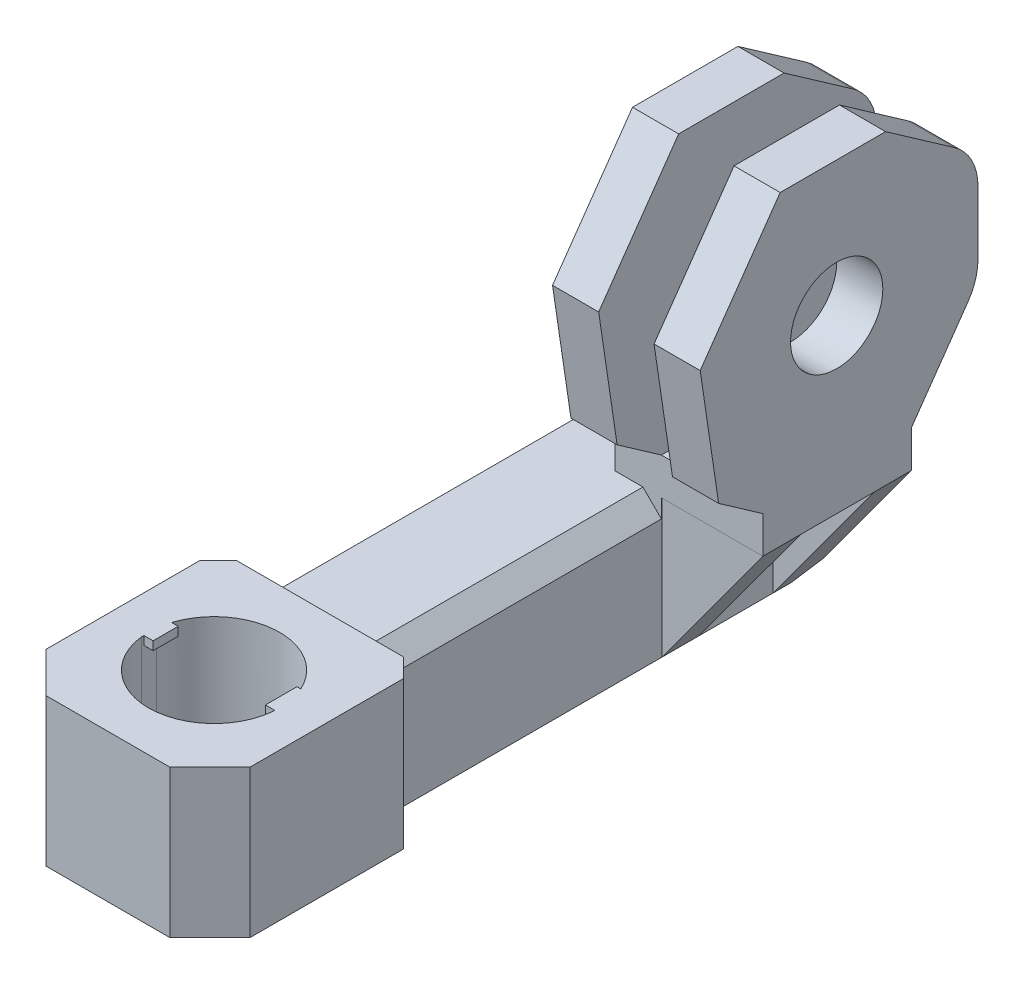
ISO-10303-21;
HEADER;
FILE_DESCRIPTION(('STEP AP214'),'2;1');
FILE_NAME('part.step','',(''),(''),'','','');
FILE_SCHEMA(('AUTOMOTIVE_DESIGN { 1 0 10303 214 1 1 1 1 }'));
ENDSEC;
DATA;
#1=APPLICATION_CONTEXT('core data for automotive mechanical design processes');
#2=APPLICATION_PROTOCOL_DEFINITION('international standard','automotive_design',2000,#1);
#3=PRODUCT_CONTEXT('',#1,'mechanical');
#4=PRODUCT('Part','Part','',(#3));
#5=PRODUCT_RELATED_PRODUCT_CATEGORY('part','',(#4));
#6=PRODUCT_DEFINITION_FORMATION('','',#4);
#7=PRODUCT_DEFINITION_CONTEXT('part definition',#1,'design');
#8=PRODUCT_DEFINITION('design','',#6,#7);
#9=PRODUCT_DEFINITION_SHAPE('','',#8);
#10=(LENGTH_UNIT() NAMED_UNIT(*) SI_UNIT(.MILLI.,.METRE.));
#11=(NAMED_UNIT(*) PLANE_ANGLE_UNIT() SI_UNIT($,.RADIAN.));
#12=(NAMED_UNIT(*) SI_UNIT($,.STERADIAN.) SOLID_ANGLE_UNIT());
#13=UNCERTAINTY_MEASURE_WITH_UNIT(LENGTH_MEASURE(1.E-05),#10,'distance_accuracy_value','');
#14=(GEOMETRIC_REPRESENTATION_CONTEXT(3) GLOBAL_UNCERTAINTY_ASSIGNED_CONTEXT((#13)) GLOBAL_UNIT_ASSIGNED_CONTEXT((#10,
#11,#12)) REPRESENTATION_CONTEXT('',''));
#15=CARTESIAN_POINT('',(0.,0.,0.));
#16=DIRECTION('',(0.,0.,1.));
#17=DIRECTION('',(1.,0.,0.));
#18=AXIS2_PLACEMENT_3D('',#15,#16,#17);
#19=CARTESIAN_POINT('',(35.5548549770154,-45.9510723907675,-118.15427952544));
#20=DIRECTION('',(1.,0.,0.));
#21=DIRECTION('',(0.,0.,-1.));
#22=AXIS2_PLACEMENT_3D('',#19,#20,#21);
#23=PLANE('',#22);
#24=DIRECTION('',(0.,1.,0.));
#25=VECTOR('',#24,1.);
#26=CARTESIAN_POINT('',(35.5548549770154,-32.,-118.15427952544));
#27=LINE('',#26,#25);
#28=CARTESIAN_POINT('',(35.5548549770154,-22.5,-118.15427952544));
#29=VERTEX_POINT('',#28);
#30=CARTESIAN_POINT('',(35.5548549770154,-30.,-118.15427952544));
#31=VERTEX_POINT('',#30);
#32=EDGE_CURVE('E487',#29,#31,#27,.F.);
#33=ORIENTED_EDGE('',*,*,#32,.T.);
#34=DIRECTION('',(0.,0.,1.));
#35=VECTOR('',#34,1.);
#36=CARTESIAN_POINT('',(35.5548549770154,-30.,-118.15427952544));
#37=LINE('',#36,#35);
#38=CARTESIAN_POINT('',(35.5548549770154,-30.,-117.34572047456));
#39=VERTEX_POINT('',#38);
#40=EDGE_CURVE('E841',#31,#39,#37,.T.);
#41=ORIENTED_EDGE('',*,*,#40,.T.);
#42=DIRECTION('',(0.,1.,0.));
#43=VECTOR('',#42,1.);
#44=CARTESIAN_POINT('',(35.5548549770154,-32.,-117.34572047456));
#45=LINE('',#44,#43);
#46=CARTESIAN_POINT('',(35.5548549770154,-22.,-117.34572047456));
#47=VERTEX_POINT('',#46);
#48=EDGE_CURVE('E884',#39,#47,#45,.T.);
#49=ORIENTED_EDGE('',*,*,#48,.T.);
#50=DIRECTION('',(0.,0.,-1.));
#51=VECTOR('',#50,1.);
#52=CARTESIAN_POINT('',(35.5548549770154,-22.,-118.15427952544));
#53=LINE('',#52,#51);
#54=CARTESIAN_POINT('',(35.5548549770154,-22.,-117.5054520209));
#55=VERTEX_POINT('',#54);
#56=EDGE_CURVE('E829',#47,#55,#53,.T.);
#57=ORIENTED_EDGE('',*,*,#56,.T.);
#58=DIRECTION('',(0.,-1.,0.));
#59=VECTOR('',#58,1.);
#60=CARTESIAN_POINT('',(35.5548549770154,-45.9510723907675,-117.5054520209));
#61=LINE('',#60,#59);
#62=CARTESIAN_POINT('',(35.5548549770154,-22.5,-117.5054520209));
#63=VERTEX_POINT('',#62);
#64=EDGE_CURVE('E815',#55,#63,#61,.T.);
#65=ORIENTED_EDGE('',*,*,#64,.T.);
#66=DIRECTION('',(0.,0.,-1.));
#67=VECTOR('',#66,1.);
#68=CARTESIAN_POINT('',(35.5548549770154,-22.5,-118.15427952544));
#69=LINE('',#68,#67);
#70=EDGE_CURVE('E826',#63,#29,#69,.T.);
#71=ORIENTED_EDGE('',*,*,#70,.T.);
#72=EDGE_LOOP('',(#33,#41,#49,#57,#65,#71));
#73=FACE_BOUND('',#72,.T.);
#74=ADVANCED_FACE('F49',(#73),#23,.F.);
#75=CARTESIAN_POINT('',(28.501045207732,-45.9510723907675,-118.15427952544));
#76=DIRECTION('',(-1.,0.,0.));
#77=DIRECTION('',(0.,0.,1.));
#78=AXIS2_PLACEMENT_3D('',#75,#76,#77);
#79=PLANE('',#78);
#80=DIRECTION('',(0.,0.,1.));
#81=VECTOR('',#80,1.);
#82=CARTESIAN_POINT('',(28.501045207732,-22.4660951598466,-118.15427952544));
#83=LINE('',#82,#81);
#84=CARTESIAN_POINT('',(28.501045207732,-22.4660951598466,-118.15427952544));
#85=VERTEX_POINT('',#84);
#86=CARTESIAN_POINT('',(28.501045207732,-22.4660951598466,-117.473268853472));
#87=VERTEX_POINT('',#86);
#88=EDGE_CURVE('E65',#85,#87,#83,.T.);
#89=ORIENTED_EDGE('',*,*,#88,.T.);
#90=DIRECTION('',(0.,1.,0.));
#91=VECTOR('',#90,1.);
#92=CARTESIAN_POINT('',(28.501045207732,-45.9510723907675,-117.473268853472));
#93=LINE('',#92,#91);
#94=CARTESIAN_POINT('',(28.501045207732,-22.,-117.473268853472));
#95=VERTEX_POINT('',#94);
#96=EDGE_CURVE('E460',#87,#95,#93,.T.);
#97=ORIENTED_EDGE('',*,*,#96,.T.);
#98=DIRECTION('',(0.,0.,1.));
#99=VECTOR('',#98,1.);
#100=CARTESIAN_POINT('',(28.501045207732,-22.,-118.15427952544));
#101=LINE('',#100,#99);
#102=CARTESIAN_POINT('',(28.501045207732,-22.,-117.34572047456));
#103=VERTEX_POINT('',#102);
#104=EDGE_CURVE('E852',#95,#103,#101,.T.);
#105=ORIENTED_EDGE('',*,*,#104,.T.);
#106=DIRECTION('',(0.,1.,0.));
#107=VECTOR('',#106,1.);
#108=CARTESIAN_POINT('',(28.501045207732,-32.,-117.34572047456));
#109=LINE('',#108,#107);
#110=CARTESIAN_POINT('',(28.501045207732,-30.,-117.34572047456));
#111=VERTEX_POINT('',#110);
#112=EDGE_CURVE('E887',#103,#111,#109,.F.);
#113=ORIENTED_EDGE('',*,*,#112,.T.);
#114=DIRECTION('',(0.,0.,-1.));
#115=VECTOR('',#114,1.);
#116=CARTESIAN_POINT('',(28.501045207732,-30.,-118.15427952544));
#117=LINE('',#116,#115);
#118=CARTESIAN_POINT('',(28.501045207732,-30.,-118.15427952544));
#119=VERTEX_POINT('',#118);
#120=EDGE_CURVE('E830',#111,#119,#117,.T.);
#121=ORIENTED_EDGE('',*,*,#120,.T.);
#122=DIRECTION('',(0.,1.,0.));
#123=VECTOR('',#122,1.);
#124=CARTESIAN_POINT('',(28.501045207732,-32.,-118.15427952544));
#125=LINE('',#124,#123);
#126=EDGE_CURVE('E464',#119,#85,#125,.T.);
#127=ORIENTED_EDGE('',*,*,#126,.T.);
#128=EDGE_LOOP('',(#89,#97,#105,#113,#121,#127));
#129=FACE_BOUND('',#128,.T.);
#130=ADVANCED_FACE('F914',(#129),#79,.F.);
#131=CARTESIAN_POINT('',(37.5548549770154,-45.9510723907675,-123.5));
#132=DIRECTION('',(0.,0.,-1.));
#133=DIRECTION('',(-1.,0.,0.));
#134=AXIS2_PLACEMENT_3D('',#131,#132,#133);
#135=PLANE('',#134);
#136=DIRECTION('',(1.,0.,0.));
#137=VECTOR('',#136,1.);
#138=CARTESIAN_POINT('',(37.5548549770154,-30.,-123.5));
#139=LINE('',#138,#137);
#140=CARTESIAN_POINT('',(35.5548549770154,-30.,-123.5));
#141=VERTEX_POINT('',#140);
#142=CARTESIAN_POINT('',(36.5548549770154,-30.,-123.5));
#143=VERTEX_POINT('',#142);
#144=EDGE_CURVE('E847',#141,#143,#139,.T.);
#145=ORIENTED_EDGE('',*,*,#144,.F.);
#146=DIRECTION('',(0.,1.,0.));
#147=VECTOR('',#146,1.);
#148=CARTESIAN_POINT('',(35.5548549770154,-45.9510723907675,-123.5));
#149=LINE('',#148,#147);
#150=CARTESIAN_POINT('',(35.5548549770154,-23.5,-123.5));
#151=VERTEX_POINT('',#150);
#152=EDGE_CURVE('E73',#141,#151,#149,.T.);
#153=ORIENTED_EDGE('',*,*,#152,.T.);
#154=DIRECTION('',(-0.707106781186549,0.707106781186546,0.));
#155=VECTOR('',#154,1.);
#156=CARTESIAN_POINT('',(47.7803911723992,-35.7255361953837,-123.5));
#157=LINE('',#156,#155);
#158=CARTESIAN_POINT('',(34.5548549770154,-22.5,-123.5));
#159=VERTEX_POINT('',#158);
#160=EDGE_CURVE('E795',#159,#151,#157,.F.);
#161=ORIENTED_EDGE('',*,*,#160,.F.);
#162=DIRECTION('',(-1.,0.,0.));
#163=VECTOR('',#162,1.);
#164=CARTESIAN_POINT('',(37.5548549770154,-22.5,-123.5));
#165=LINE('',#164,#163);
#166=CARTESIAN_POINT('',(29.501045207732,-22.5,-123.5));
#167=VERTEX_POINT('',#166);
#168=EDGE_CURVE('E797',#159,#167,#165,.T.);
#169=ORIENTED_EDGE('',*,*,#168,.T.);
#170=DIRECTION('',(-0.70710678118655,-0.707106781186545,0.));
#171=VECTOR('',#170,1.);
#172=CARTESIAN_POINT('',(21.8024138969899,-30.198631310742,-123.5));
#173=LINE('',#172,#171);
#174=CARTESIAN_POINT('',(28.501045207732,-23.5,-123.5));
#175=VERTEX_POINT('',#174);
#176=EDGE_CURVE('E792',#175,#167,#173,.F.);
#177=ORIENTED_EDGE('',*,*,#176,.F.);
#178=DIRECTION('',(0.,-1.,0.));
#179=VECTOR('',#178,1.);
#180=CARTESIAN_POINT('',(28.501045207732,-45.9510723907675,-123.5));
#181=LINE('',#180,#179);
#182=CARTESIAN_POINT('',(28.501045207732,-30.,-123.5));
#183=VERTEX_POINT('',#182);
#184=EDGE_CURVE('E790',#175,#183,#181,.T.);
#185=ORIENTED_EDGE('',*,*,#184,.T.);
#186=CARTESIAN_POINT('',(27.5010452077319,-30.,-123.5));
#187=VERTEX_POINT('',#186);
#188=EDGE_CURVE('E834',#187,#183,#139,.T.);
#189=ORIENTED_EDGE('',*,*,#188,.F.);
#190=DIRECTION('',(0.,1.,0.));
#191=VECTOR('',#190,1.);
#192=CARTESIAN_POINT('',(27.5010452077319,-45.9510723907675,-123.5));
#193=LINE('',#192,#191);
#194=CARTESIAN_POINT('',(27.5010452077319,-22.,-123.5));
#195=VERTEX_POINT('',#194);
#196=EDGE_CURVE('E893',#187,#195,#193,.T.);
#197=ORIENTED_EDGE('',*,*,#196,.T.);
#198=DIRECTION('',(-1.,0.,0.));
#199=VECTOR('',#198,1.);
#200=CARTESIAN_POINT('',(37.5548549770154,-22.,-123.5));
#201=LINE('',#200,#199);
#202=CARTESIAN_POINT('',(36.5548549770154,-22.,-123.5));
#203=VERTEX_POINT('',#202);
#204=EDGE_CURVE('E854',#203,#195,#201,.T.);
#205=ORIENTED_EDGE('',*,*,#204,.F.);
#206=DIRECTION('',(0.,-1.,0.));
#207=VECTOR('',#206,1.);
#208=CARTESIAN_POINT('',(36.5548549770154,-45.9510723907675,-123.5));
#209=LINE('',#208,#207);
#210=EDGE_CURVE('E890',#203,#143,#209,.T.);
#211=ORIENTED_EDGE('',*,*,#210,.T.);
#212=EDGE_LOOP('',(#145,#153,#161,#169,#177,#185,#189,#197,#205,#211));
#213=FACE_BOUND('',#212,.T.);
#214=ADVANCED_FACE('F950',(#213),#135,.T.);
#215=CARTESIAN_POINT('',(35.0548549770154,-22.5,-117.5054520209));
#216=DIRECTION('',(0.,-1.,0.));
#217=DIRECTION('',(0.,0.,-1.));
#218=AXIS2_PLACEMENT_3D('',#215,#216,#217);
#219=PLANE('',#218);
#220=DIRECTION('',(1.,0.,0.));
#221=VECTOR('',#220,1.);
#222=CARTESIAN_POINT('',(35.0548549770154,-22.5,-119.217144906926));
#223=LINE('',#222,#221);
#224=CARTESIAN_POINT('',(35.0548549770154,-22.5,-119.217144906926));
#225=VERTEX_POINT('',#224);
#226=CARTESIAN_POINT('',(35.260593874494,-22.5,-119.217144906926));
#227=VERTEX_POINT('',#226);
#228=EDGE_CURVE('E819',#225,#227,#223,.T.);
#229=ORIENTED_EDGE('',*,*,#228,.T.);
#230=CARTESIAN_POINT('',(32.0279500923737,-22.5,-117.75));
#231=DIRECTION('',(0.,-1.,0.));
#232=DIRECTION('',(0.,0.,-1.));
#233=AXIS2_PLACEMENT_3D('',#230,#231,#232);
#234=CIRCLE('',#233,3.55);
#235=EDGE_CURVE('E776',#227,#29,#234,.T.);
#236=ORIENTED_EDGE('',*,*,#235,.T.);
#237=ORIENTED_EDGE('',*,*,#70,.F.);
#238=DIRECTION('',(1.,0.,0.));
#239=VECTOR('',#238,1.);
#240=CARTESIAN_POINT('',(35.0548549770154,-22.5,-117.5054520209));
#241=LINE('',#240,#239);
#242=CARTESIAN_POINT('',(35.0548549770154,-22.5,-117.5054520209));
#243=VERTEX_POINT('',#242);
#244=EDGE_CURVE('E811',#243,#63,#241,.T.);
#245=ORIENTED_EDGE('',*,*,#244,.F.);
#246=DIRECTION('',(0.,0.,-1.));
#247=VECTOR('',#246,1.);
#248=CARTESIAN_POINT('',(35.0548549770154,-22.5,-117.5054520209));
#249=LINE('',#248,#247);
#250=EDGE_CURVE('E802',#243,#225,#249,.T.);
#251=ORIENTED_EDGE('',*,*,#250,.T.);
#252=EDGE_LOOP('',(#229,#236,#237,#245,#251));
#253=FACE_BOUND('',#252,.T.);
#254=ADVANCED_FACE('F923',(#253),#219,.T.);
#255=CARTESIAN_POINT('',(35.0548549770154,-22.,-119.217144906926));
#256=DIRECTION('',(0.,0.,-1.));
#257=DIRECTION('',(-1.,0.,0.));
#258=AXIS2_PLACEMENT_3D('',#255,#256,#257);
#259=PLANE('',#258);
#260=DIRECTION('',(1.,0.,0.));
#261=VECTOR('',#260,1.);
#262=CARTESIAN_POINT('',(35.0548549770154,-22.,-119.217144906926));
#263=LINE('',#262,#261);
#264=CARTESIAN_POINT('',(35.0548549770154,-22.,-119.217144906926));
#265=VERTEX_POINT('',#264);
#266=CARTESIAN_POINT('',(35.260593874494,-22.,-119.217144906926));
#267=VERTEX_POINT('',#266);
#268=EDGE_CURVE('E816',#265,#267,#263,.T.);
#269=ORIENTED_EDGE('',*,*,#268,.T.);
#270=DIRECTION('',(0.,1.,0.));
#271=VECTOR('',#270,1.);
#272=CARTESIAN_POINT('',(35.260593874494,-32.,-119.217144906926));
#273=LINE('',#272,#271);
#274=EDGE_CURVE('E909',#267,#227,#273,.F.);
#275=ORIENTED_EDGE('',*,*,#274,.T.);
#276=ORIENTED_EDGE('',*,*,#228,.F.);
#277=DIRECTION('',(0.,1.,0.));
#278=VECTOR('',#277,1.);
#279=CARTESIAN_POINT('',(35.0548549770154,-22.,-119.217144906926));
#280=LINE('',#279,#278);
#281=EDGE_CURVE('E805',#225,#265,#280,.T.);
#282=ORIENTED_EDGE('',*,*,#281,.T.);
#283=EDGE_LOOP('',(#269,#275,#276,#282));
#284=FACE_BOUND('',#283,.T.);
#285=ADVANCED_FACE('F939',(#284),#259,.T.);
#286=CARTESIAN_POINT('',(26.501045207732,-45.9510723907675,-123.5));
#287=DIRECTION('',(-1.,0.,0.));
#288=DIRECTION('',(0.,0.,1.));
#289=AXIS2_PLACEMENT_3D('',#286,#287,#288);
#290=PLANE('',#289);
#291=DIRECTION('',(0.,1.,0.));
#292=VECTOR('',#291,1.);
#293=CARTESIAN_POINT('',(26.501045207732,-45.9510723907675,-114.171572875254));
#294=LINE('',#293,#292);
#295=CARTESIAN_POINT('',(26.501045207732,-30.,-114.171572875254));
#296=VERTEX_POINT('',#295);
#297=CARTESIAN_POINT('',(26.501045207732,-22.,-114.171572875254));
#298=VERTEX_POINT('',#297);
#299=EDGE_CURVE('E870',#296,#298,#294,.T.);
#300=ORIENTED_EDGE('',*,*,#299,.T.);
#301=DIRECTION('',(0.,0.,1.));
#302=VECTOR('',#301,1.);
#303=CARTESIAN_POINT('',(26.501045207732,-22.,-123.5));
#304=LINE('',#303,#302);
#305=CARTESIAN_POINT('',(26.501045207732,-22.,-122.5));
#306=VERTEX_POINT('',#305);
#307=EDGE_CURVE('E857',#306,#298,#304,.T.);
#308=ORIENTED_EDGE('',*,*,#307,.F.);
#309=DIRECTION('',(0.,-1.,0.));
#310=VECTOR('',#309,1.);
#311=CARTESIAN_POINT('',(26.501045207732,-45.9510723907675,-122.5));
#312=LINE('',#311,#310);
#313=CARTESIAN_POINT('',(26.501045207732,-30.,-122.5));
#314=VERTEX_POINT('',#313);
#315=EDGE_CURVE('E900',#306,#314,#312,.T.);
#316=ORIENTED_EDGE('',*,*,#315,.T.);
#317=DIRECTION('',(0.,0.,-1.));
#318=VECTOR('',#317,1.);
#319=CARTESIAN_POINT('',(26.501045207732,-30.,-123.5));
#320=LINE('',#319,#318);
#321=EDGE_CURVE('E833',#296,#314,#320,.T.);
#322=ORIENTED_EDGE('',*,*,#321,.F.);
#323=EDGE_LOOP('',(#300,#308,#316,#322));
#324=FACE_BOUND('',#323,.T.);
#325=ADVANCED_FACE('F941',(#324),#290,.T.);
#326=CARTESIAN_POINT('',(26.501045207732,-45.9510723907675,-114.171572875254));
#327=DIRECTION('',(-0.707106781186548,0.,0.707106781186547));
#328=DIRECTION('',(0.707106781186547,0.,0.707106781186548));
#329=AXIS2_PLACEMENT_3D('',#326,#327,#328);
#330=PLANE('',#329);
#331=DIRECTION('',(-0.707106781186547,0.,-0.707106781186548));
#332=VECTOR('',#331,1.);
#333=CARTESIAN_POINT('',(26.501045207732,-30.,-114.171572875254));
#334=LINE('',#333,#332);
#335=CARTESIAN_POINT('',(28.6726180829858,-30.,-112.));
#336=VERTEX_POINT('',#335);
#337=EDGE_CURVE('E838',#336,#296,#334,.T.);
#338=ORIENTED_EDGE('',*,*,#337,.F.);
#339=DIRECTION('',(0.,1.,0.));
#340=VECTOR('',#339,1.);
#341=CARTESIAN_POINT('',(28.6726180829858,-45.9510723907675,-112.));
#342=LINE('',#341,#340);
#343=CARTESIAN_POINT('',(28.6726180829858,-22.,-112.));
#344=VERTEX_POINT('',#343);
#345=EDGE_CURVE('E875',#336,#344,#342,.T.);
#346=ORIENTED_EDGE('',*,*,#345,.T.);
#347=DIRECTION('',(0.707106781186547,0.,0.707106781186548));
#348=VECTOR('',#347,1.);
#349=CARTESIAN_POINT('',(26.501045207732,-22.,-114.171572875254));
#350=LINE('',#349,#348);
#351=EDGE_CURVE('E859',#298,#344,#350,.T.);
#352=ORIENTED_EDGE('',*,*,#351,.F.);
#353=ORIENTED_EDGE('',*,*,#299,.F.);
#354=EDGE_LOOP('',(#338,#346,#352,#353));
#355=FACE_BOUND('',#354,.T.);
#356=ADVANCED_FACE('F947',(#355),#330,.T.);
#357=CARTESIAN_POINT('',(28.6726180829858,-45.9510723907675,-112.));
#358=DIRECTION('',(0.,0.,1.));
#359=DIRECTION('',(1.,0.,0.));
#360=AXIS2_PLACEMENT_3D('',#357,#358,#359);
#361=PLANE('',#360);
#362=DIRECTION('',(-1.,0.,0.));
#363=VECTOR('',#362,1.);
#364=CARTESIAN_POINT('',(28.6726180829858,-30.,-112.));
#365=LINE('',#364,#363);
#366=CARTESIAN_POINT('',(35.3832821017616,-30.,-112.));
#367=VERTEX_POINT('',#366);
#368=EDGE_CURVE('E840',#367,#336,#365,.T.);
#369=ORIENTED_EDGE('',*,*,#368,.F.);
#370=DIRECTION('',(0.,1.,0.));
#371=VECTOR('',#370,1.);
#372=CARTESIAN_POINT('',(35.3832821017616,-45.9510723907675,-112.));
#373=LINE('',#372,#371);
#374=CARTESIAN_POINT('',(35.3832821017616,-22.,-112.));
#375=VERTEX_POINT('',#374);
#376=EDGE_CURVE('E873',#367,#375,#373,.T.);
#377=ORIENTED_EDGE('',*,*,#376,.T.);
#378=DIRECTION('',(1.,0.,0.));
#379=VECTOR('',#378,1.);
#380=CARTESIAN_POINT('',(28.6726180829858,-22.,-112.));
#381=LINE('',#380,#379);
#382=EDGE_CURVE('E862',#344,#375,#381,.T.);
#383=ORIENTED_EDGE('',*,*,#382,.F.);
#384=ORIENTED_EDGE('',*,*,#345,.F.);
#385=EDGE_LOOP('',(#369,#377,#383,#384));
#386=FACE_BOUND('',#385,.T.);
#387=ADVANCED_FACE('F968',(#386),#361,.T.);
#388=CARTESIAN_POINT('',(35.3832821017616,-45.9510723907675,-112.));
#389=DIRECTION('',(0.707106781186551,0.,0.707106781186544));
#390=DIRECTION('',(0.707106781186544,0.,-0.707106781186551));
#391=AXIS2_PLACEMENT_3D('',#388,#389,#390);
#392=PLANE('',#391);
#393=DIRECTION('',(-0.707106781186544,0.,0.707106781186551));
#394=VECTOR('',#393,1.);
#395=CARTESIAN_POINT('',(35.3832821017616,-30.,-112.));
#396=LINE('',#395,#394);
#397=CARTESIAN_POINT('',(37.5548549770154,-30.,-114.171572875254));
#398=VERTEX_POINT('',#397);
#399=EDGE_CURVE('E843',#398,#367,#396,.T.);
#400=ORIENTED_EDGE('',*,*,#399,.F.);
#401=DIRECTION('',(0.,1.,0.));
#402=VECTOR('',#401,1.);
#403=CARTESIAN_POINT('',(37.5548549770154,-45.9510723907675,-114.171572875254));
#404=LINE('',#403,#402);
#405=CARTESIAN_POINT('',(37.5548549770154,-22.,-114.171572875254));
#406=VERTEX_POINT('',#405);
#407=EDGE_CURVE('E871',#398,#406,#404,.T.);
#408=ORIENTED_EDGE('',*,*,#407,.T.);
#409=DIRECTION('',(0.707106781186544,0.,-0.707106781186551));
#410=VECTOR('',#409,1.);
#411=CARTESIAN_POINT('',(35.3832821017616,-22.,-112.));
#412=LINE('',#411,#410);
#413=EDGE_CURVE('E865',#375,#406,#412,.T.);
#414=ORIENTED_EDGE('',*,*,#413,.F.);
#415=ORIENTED_EDGE('',*,*,#376,.F.);
#416=EDGE_LOOP('',(#400,#408,#414,#415));
#417=FACE_BOUND('',#416,.T.);
#418=ADVANCED_FACE('F964',(#417),#392,.T.);
#419=CARTESIAN_POINT('',(37.5548549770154,-45.9510723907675,-114.171572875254));
#420=DIRECTION('',(1.,0.,0.));
#421=DIRECTION('',(0.,0.,-1.));
#422=AXIS2_PLACEMENT_3D('',#419,#420,#421);
#423=PLANE('',#422);
#424=DIRECTION('',(0.,1.,0.));
#425=VECTOR('',#424,1.);
#426=CARTESIAN_POINT('',(37.5548549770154,-45.9510723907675,-122.5));
#427=LINE('',#426,#425);
#428=CARTESIAN_POINT('',(37.5548549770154,-30.,-122.5));
#429=VERTEX_POINT('',#428);
#430=CARTESIAN_POINT('',(37.5548549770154,-22.,-122.5));
#431=VERTEX_POINT('',#430);
#432=EDGE_CURVE('E906',#429,#431,#427,.T.);
#433=ORIENTED_EDGE('',*,*,#432,.T.);
#434=DIRECTION('',(0.,0.,-1.));
#435=VECTOR('',#434,1.);
#436=CARTESIAN_POINT('',(37.5548549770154,-22.,-114.171572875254));
#437=LINE('',#436,#435);
#438=EDGE_CURVE('E868',#406,#431,#437,.T.);
#439=ORIENTED_EDGE('',*,*,#438,.F.);
#440=ORIENTED_EDGE('',*,*,#407,.F.);
#441=DIRECTION('',(0.,0.,1.));
#442=VECTOR('',#441,1.);
#443=CARTESIAN_POINT('',(37.5548549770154,-30.,-114.171572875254));
#444=LINE('',#443,#442);
#445=EDGE_CURVE('E845',#429,#398,#444,.T.);
#446=ORIENTED_EDGE('',*,*,#445,.F.);
#447=EDGE_LOOP('',(#433,#439,#440,#446));
#448=FACE_BOUND('',#447,.T.);
#449=ADVANCED_FACE('F961',(#448),#423,.T.);
#450=CARTESIAN_POINT('',(0.,-30.,0.));
#451=DIRECTION('',(0.,1.,0.));
#452=DIRECTION('',(0.,0.,1.));
#453=AXIS2_PLACEMENT_3D('',#450,#451,#452);
#454=PLANE('',#453);
#455=ORIENTED_EDGE('',*,*,#188,.T.);
#456=DIRECTION('',(0.,0.,-1.));
#457=VECTOR('',#456,1.);
#458=CARTESIAN_POINT('',(28.501045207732,-30.,0.));
#459=LINE('',#458,#457);
#460=CARTESIAN_POINT('',(28.501045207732,-30.,-145.5));
#461=VERTEX_POINT('',#460);
#462=EDGE_CURVE('E733',#183,#461,#459,.T.);
#463=ORIENTED_EDGE('',*,*,#462,.T.);
#464=DIRECTION('',(1.,0.,0.));
#465=VECTOR('',#464,1.);
#466=CARTESIAN_POINT('',(0.,-30.,-145.5));
#467=LINE('',#466,#465);
#468=CARTESIAN_POINT('',(35.5548549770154,-30.,-145.5));
#469=VERTEX_POINT('',#468);
#470=EDGE_CURVE('E763',#461,#469,#467,.T.);
#471=ORIENTED_EDGE('',*,*,#470,.T.);
#472=DIRECTION('',(0.,0.,1.));
#473=VECTOR('',#472,1.);
#474=CARTESIAN_POINT('',(35.5548549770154,-30.,-121.5));
#475=LINE('',#474,#473);
#476=CARTESIAN_POINT('',(35.5548549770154,-30.,-144.5));
#477=VERTEX_POINT('',#476);
#478=EDGE_CURVE('E731',#469,#477,#475,.T.);
#479=ORIENTED_EDGE('',*,*,#478,.T.);
#480=CARTESIAN_POINT('',(35.5548549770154,-30.,-140.5));
#481=VERTEX_POINT('',#480);
#482=EDGE_CURVE('E468',#477,#481,#475,.T.);
#483=ORIENTED_EDGE('',*,*,#482,.T.);
#484=DIRECTION('',(0.,0.,-1.));
#485=VECTOR('',#484,1.);
#486=CARTESIAN_POINT('',(35.5548549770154,-30.,-138.5));
#487=LINE('',#486,#485);
#488=CARTESIAN_POINT('',(35.5548549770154,-30.,-138.5));
#489=VERTEX_POINT('',#488);
#490=EDGE_CURVE('E483',#489,#481,#487,.T.);
#491=ORIENTED_EDGE('',*,*,#490,.F.);
#492=EDGE_CURVE('E734',#489,#141,#475,.T.);
#493=ORIENTED_EDGE('',*,*,#492,.T.);
#494=ORIENTED_EDGE('',*,*,#144,.T.);
#495=DIRECTION('',(-0.707106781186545,0.,-0.70710678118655));
#496=VECTOR('',#495,1.);
#497=CARTESIAN_POINT('',(37.5548549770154,-30.,-122.5));
#498=LINE('',#497,#496);
#499=EDGE_CURVE('E902',#143,#429,#498,.F.);
#500=ORIENTED_EDGE('',*,*,#499,.T.);
#501=ORIENTED_EDGE('',*,*,#445,.T.);
#502=ORIENTED_EDGE('',*,*,#399,.T.);
#503=ORIENTED_EDGE('',*,*,#368,.T.);
#504=ORIENTED_EDGE('',*,*,#337,.T.);
#505=ORIENTED_EDGE('',*,*,#321,.T.);
#506=DIRECTION('',(-0.707106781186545,0.,0.70710678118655));
#507=VECTOR('',#506,1.);
#508=CARTESIAN_POINT('',(27.5010452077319,-30.,-123.5));
#509=LINE('',#508,#507);
#510=EDGE_CURVE('E904',#314,#187,#509,.F.);
#511=ORIENTED_EDGE('',*,*,#510,.T.);
#512=EDGE_LOOP('',(#455,#463,#471,#479,#483,#491,#493,#494,#500,#501,#502,#503,#504,#505,#511));
#513=FACE_BOUND('',#512,.T.);
#514=CARTESIAN_POINT('',(32.0279500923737,-30.,-117.75));
#515=DIRECTION('',(0.,1.,0.));
#516=DIRECTION('',(0.,0.,1.));
#517=AXIS2_PLACEMENT_3D('',#514,#515,#516);
#518=CIRCLE('',#517,3.55);
#519=EDGE_CURVE('E736',#31,#119,#518,.T.);
#520=ORIENTED_EDGE('',*,*,#519,.T.);
#521=ORIENTED_EDGE('',*,*,#120,.F.);
#522=CARTESIAN_POINT('',(32.0279500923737,-30.,-117.75));
#523=DIRECTION('',(0.,1.,0.));
#524=DIRECTION('',(0.,0.,1.));
#525=AXIS2_PLACEMENT_3D('',#522,#523,#524);
#526=CIRCLE('',#525,3.55);
#527=EDGE_CURVE('E881',#111,#39,#526,.T.);
#528=ORIENTED_EDGE('',*,*,#527,.T.);
#529=ORIENTED_EDGE('',*,*,#40,.F.);
#530=EDGE_LOOP('',(#520,#521,#528,#529));
#531=FACE_BOUND('',#530,.T.);
#532=ADVANCED_FACE('F918',(#513,#531),#454,.F.);
#533=CARTESIAN_POINT('',(0.,-22.,0.));
#534=DIRECTION('',(0.,1.,0.));
#535=DIRECTION('',(0.,0.,1.));
#536=AXIS2_PLACEMENT_3D('',#533,#534,#535);
#537=PLANE('',#536);
#538=ORIENTED_EDGE('',*,*,#104,.F.);
#539=DIRECTION('',(-1.,0.,0.));
#540=VECTOR('',#539,1.);
#541=CARTESIAN_POINT('',(29.0010452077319,-22.,-117.473268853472));
#542=LINE('',#541,#540);
#543=CARTESIAN_POINT('',(29.0010452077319,-22.,-117.473268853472));
#544=VERTEX_POINT('',#543);
#545=EDGE_CURVE('E456',#544,#95,#542,.T.);
#546=ORIENTED_EDGE('',*,*,#545,.F.);
#547=DIRECTION('',(0.,0.,-1.));
#548=VECTOR('',#547,1.);
#549=CARTESIAN_POINT('',(29.0010452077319,-22.,-118.834971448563));
#550=LINE('',#549,#548);
#551=CARTESIAN_POINT('',(29.0010452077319,-22.,-118.834971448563));
#552=VERTEX_POINT('',#551);
#553=EDGE_CURVE('E436',#544,#552,#550,.T.);
#554=ORIENTED_EDGE('',*,*,#553,.T.);
#555=DIRECTION('',(-1.,0.,0.));
#556=VECTOR('',#555,1.);
#557=CARTESIAN_POINT('',(29.0010452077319,-22.,-118.834971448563));
#558=LINE('',#557,#556);
#559=CARTESIAN_POINT('',(28.6478114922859,-22.,-118.834971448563));
#560=VERTEX_POINT('',#559);
#561=EDGE_CURVE('E450',#552,#560,#558,.T.);
#562=ORIENTED_EDGE('',*,*,#561,.T.);
#563=CARTESIAN_POINT('',(32.0279500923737,-22.,-117.75));
#564=DIRECTION('',(0.,1.,0.));
#565=DIRECTION('',(0.,0.,1.));
#566=AXIS2_PLACEMENT_3D('',#563,#564,#565);
#567=CIRCLE('',#566,3.55);
#568=EDGE_CURVE('E739',#267,#560,#567,.T.);
#569=ORIENTED_EDGE('',*,*,#568,.F.);
#570=ORIENTED_EDGE('',*,*,#268,.F.);
#571=DIRECTION('',(0.,0.,1.));
#572=VECTOR('',#571,1.);
#573=CARTESIAN_POINT('',(35.0548549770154,-22.,-117.5054520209));
#574=LINE('',#573,#572);
#575=CARTESIAN_POINT('',(35.0548549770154,-22.,-117.5054520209));
#576=VERTEX_POINT('',#575);
#577=EDGE_CURVE('E808',#265,#576,#574,.T.);
#578=ORIENTED_EDGE('',*,*,#577,.T.);
#579=DIRECTION('',(1.,0.,0.));
#580=VECTOR('',#579,1.);
#581=CARTESIAN_POINT('',(35.0548549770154,-22.,-117.5054520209));
#582=LINE('',#581,#580);
#583=EDGE_CURVE('E812',#576,#55,#582,.T.);
#584=ORIENTED_EDGE('',*,*,#583,.T.);
#585=ORIENTED_EDGE('',*,*,#56,.F.);
#586=CARTESIAN_POINT('',(32.0279500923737,-22.,-117.75));
#587=DIRECTION('',(0.,1.,0.));
#588=DIRECTION('',(0.,0.,1.));
#589=AXIS2_PLACEMENT_3D('',#586,#587,#588);
#590=CIRCLE('',#589,3.55);
#591=EDGE_CURVE('E837',#103,#47,#590,.T.);
#592=ORIENTED_EDGE('',*,*,#591,.F.);
#593=EDGE_LOOP('',(#538,#546,#554,#562,#569,#570,#578,#584,#585,#592));
#594=FACE_BOUND('',#593,.T.);
#595=ORIENTED_EDGE('',*,*,#307,.T.);
#596=ORIENTED_EDGE('',*,*,#351,.T.);
#597=ORIENTED_EDGE('',*,*,#382,.T.);
#598=ORIENTED_EDGE('',*,*,#413,.T.);
#599=ORIENTED_EDGE('',*,*,#438,.T.);
#600=DIRECTION('',(0.707106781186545,0.,0.70710678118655));
#601=VECTOR('',#600,1.);
#602=CARTESIAN_POINT('',(80.0274274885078,-22.,-80.0274274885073));
#603=LINE('',#602,#601);
#604=EDGE_CURVE('E896',#431,#203,#603,.F.);
#605=ORIENTED_EDGE('',*,*,#604,.T.);
#606=ORIENTED_EDGE('',*,*,#204,.T.);
#607=DIRECTION('',(0.707106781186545,0.,-0.70710678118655));
#608=VECTOR('',#607,1.);
#609=CARTESIAN_POINT('',(-47.9994773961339,-22.,-47.9994773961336));
#610=LINE('',#609,#608);
#611=EDGE_CURVE('E898',#195,#306,#610,.F.);
#612=ORIENTED_EDGE('',*,*,#611,.T.);
#613=EDGE_LOOP('',(#595,#596,#597,#598,#599,#605,#606,#612));
#614=FACE_BOUND('',#613,.T.);
#615=ADVANCED_FACE('F934',(#594,#614),#537,.T.);
#616=CARTESIAN_POINT('',(32.0279500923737,-32.,-117.75));
#617=DIRECTION('',(0.,1.,0.));
#618=DIRECTION('',(0.,0.,1.));
#619=AXIS2_PLACEMENT_3D('',#616,#617,#618);
#620=CYLINDRICAL_SURFACE('',#619,3.55);
#621=ORIENTED_EDGE('',*,*,#527,.F.);
#622=ORIENTED_EDGE('',*,*,#112,.F.);
#623=ORIENTED_EDGE('',*,*,#591,.T.);
#624=ORIENTED_EDGE('',*,*,#48,.F.);
#625=EDGE_LOOP('',(#621,#622,#623,#624));
#626=FACE_BOUND('',#625,.T.);
#627=ADVANCED_FACE('F978',(#626),#620,.F.);
#628=CARTESIAN_POINT('',(27.5010452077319,-45.9510723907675,-123.5));
#629=DIRECTION('',(0.70710678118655,0.,0.707106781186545));
#630=DIRECTION('',(0.,1.,0.));
#631=AXIS2_PLACEMENT_3D('',#628,#629,#630);
#632=PLANE('',#631);
#633=ORIENTED_EDGE('',*,*,#510,.F.);
#634=ORIENTED_EDGE('',*,*,#315,.F.);
#635=ORIENTED_EDGE('',*,*,#611,.F.);
#636=ORIENTED_EDGE('',*,*,#196,.F.);
#637=EDGE_LOOP('',(#633,#634,#635,#636));
#638=FACE_BOUND('',#637,.T.);
#639=ADVANCED_FACE('F981',(#638),#632,.F.);
#640=CARTESIAN_POINT('',(37.5548549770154,-45.9510723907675,-122.5));
#641=DIRECTION('',(-0.70710678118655,0.,0.707106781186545));
#642=DIRECTION('',(0.,1.,0.));
#643=AXIS2_PLACEMENT_3D('',#640,#641,#642);
#644=PLANE('',#643);
#645=ORIENTED_EDGE('',*,*,#499,.F.);
#646=ORIENTED_EDGE('',*,*,#210,.F.);
#647=ORIENTED_EDGE('',*,*,#604,.F.);
#648=ORIENTED_EDGE('',*,*,#432,.F.);
#649=EDGE_LOOP('',(#645,#646,#647,#648));
#650=FACE_BOUND('',#649,.T.);
#651=ADVANCED_FACE('F52',(#650),#644,.F.);
#652=CARTESIAN_POINT('',(35.0548549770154,-22.,-117.5054520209));
#653=DIRECTION('',(0.,0.,1.));
#654=DIRECTION('',(1.,0.,0.));
#655=AXIS2_PLACEMENT_3D('',#652,#653,#654);
#656=PLANE('',#655);
#657=ORIENTED_EDGE('',*,*,#64,.F.);
#658=ORIENTED_EDGE('',*,*,#583,.F.);
#659=DIRECTION('',(0.,-1.,0.));
#660=VECTOR('',#659,1.);
#661=CARTESIAN_POINT('',(35.0548549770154,-22.,-117.5054520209));
#662=LINE('',#661,#660);
#663=EDGE_CURVE('E799',#576,#243,#662,.T.);
#664=ORIENTED_EDGE('',*,*,#663,.T.);
#665=ORIENTED_EDGE('',*,*,#244,.T.);
#666=EDGE_LOOP('',(#657,#658,#664,#665));
#667=FACE_BOUND('',#666,.T.);
#668=ADVANCED_FACE('F926',(#667),#656,.T.);
#669=CARTESIAN_POINT('',(35.0548549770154,0.,0.));
#670=DIRECTION('',(1.,0.,0.));
#671=DIRECTION('',(0.,0.,-1.));
#672=AXIS2_PLACEMENT_3D('',#669,#670,#671);
#673=PLANE('',#672);
#674=ORIENTED_EDGE('',*,*,#663,.F.);
#675=ORIENTED_EDGE('',*,*,#577,.F.);
#676=ORIENTED_EDGE('',*,*,#281,.F.);
#677=ORIENTED_EDGE('',*,*,#250,.F.);
#678=EDGE_LOOP('',(#674,#675,#676,#677));
#679=FACE_BOUND('',#678,.T.);
#680=ADVANCED_FACE('F930',(#679),#673,.F.);
#681=CARTESIAN_POINT('',(32.0279500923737,-32.,-117.75));
#682=DIRECTION('',(0.,1.,0.));
#683=DIRECTION('',(0.,0.,1.));
#684=AXIS2_PLACEMENT_3D('',#681,#682,#683);
#685=CYLINDRICAL_SURFACE('',#684,3.55);
#686=ORIENTED_EDGE('',*,*,#568,.T.);
#687=DIRECTION('',(0.,1.,0.));
#688=VECTOR('',#687,1.);
#689=CARTESIAN_POINT('',(28.6478114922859,-32.,-118.834971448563));
#690=LINE('',#689,#688);
#691=CARTESIAN_POINT('',(28.6478114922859,-22.4660951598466,-118.834971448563));
#692=VERTEX_POINT('',#691);
#693=EDGE_CURVE('E11',#560,#692,#690,.F.);
#694=ORIENTED_EDGE('',*,*,#693,.T.);
#695=CARTESIAN_POINT('',(32.0279500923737,-22.4660951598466,-117.75));
#696=DIRECTION('',(0.,-1.,0.));
#697=DIRECTION('',(0.,0.,-1.));
#698=AXIS2_PLACEMENT_3D('',#695,#696,#697);
#699=CIRCLE('',#698,3.55);
#700=EDGE_CURVE('E58',#692,#85,#699,.F.);
#701=ORIENTED_EDGE('',*,*,#700,.T.);
#702=ORIENTED_EDGE('',*,*,#126,.F.);
#703=ORIENTED_EDGE('',*,*,#519,.F.);
#704=ORIENTED_EDGE('',*,*,#32,.F.);
#705=ORIENTED_EDGE('',*,*,#235,.F.);
#706=ORIENTED_EDGE('',*,*,#274,.F.);
#707=EDGE_LOOP('',(#686,#694,#701,#702,#703,#704,#705,#706));
#708=FACE_BOUND('',#707,.T.);
#709=ADVANCED_FACE('F912',(#708),#685,.F.);
#710=CARTESIAN_POINT('',(28.501045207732,-32.5,-141.5));
#711=DIRECTION('',(1.,0.,0.));
#712=DIRECTION('',(0.,0.,-1.));
#713=AXIS2_PLACEMENT_3D('',#710,#711,#712);
#714=PLANE('',#713);
#715=ORIENTED_EDGE('',*,*,#184,.F.);
#716=DIRECTION('',(0.,0.,-1.));
#717=VECTOR('',#716,1.);
#718=CARTESIAN_POINT('',(28.501045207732,-23.5,-141.5));
#719=LINE('',#718,#717);
#720=CARTESIAN_POINT('',(28.501045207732,-23.5,-145.5));
#721=VERTEX_POINT('',#720);
#722=EDGE_CURVE('E767',#175,#721,#719,.T.);
#723=ORIENTED_EDGE('',*,*,#722,.T.);
#724=DIRECTION('',(0.,-1.,0.));
#725=VECTOR('',#724,1.);
#726=CARTESIAN_POINT('',(28.501045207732,-32.5,-145.5));
#727=LINE('',#726,#725);
#728=EDGE_CURVE('E769',#721,#461,#727,.T.);
#729=ORIENTED_EDGE('',*,*,#728,.T.);
#730=ORIENTED_EDGE('',*,*,#462,.F.);
#731=EDGE_LOOP('',(#715,#723,#729,#730));
#732=FACE_BOUND('',#731,.T.);
#733=ADVANCED_FACE('F1006',(#732),#714,.F.);
#734=CARTESIAN_POINT('',(107.554854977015,-13.2,-142.45570561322));
#735=DIRECTION('',(-1.,0.,0.));
#736=DIRECTION('',(0.,-0.819152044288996,0.573576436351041));
#737=AXIS2_PLACEMENT_3D('',#734,#735,#736);
#738=CYLINDRICAL_SURFACE('',#737,2.5);
#739=CARTESIAN_POINT('',(41.0548549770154,-13.2,-142.45570561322));
#740=DIRECTION('',(-1.,0.,0.));
#741=DIRECTION('',(0.,-0.819152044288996,0.573576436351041));
#742=AXIS2_PLACEMENT_3D('',#739,#740,#741);
#743=CIRCLE('',#742,2.5);
#744=CARTESIAN_POINT('',(41.0548549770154,-11.1521198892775,-143.889646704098));
#745=VERTEX_POINT('',#744);
#746=CARTESIAN_POINT('',(41.0548549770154,-15.2478801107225,-141.021764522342));
#747=VERTEX_POINT('',#746);
#748=EDGE_CURVE('E655',#745,#747,#743,.T.);
#749=ORIENTED_EDGE('',*,*,#748,.F.);
#750=DIRECTION('',(-1.,0.,0.));
#751=VECTOR('',#750,1.);
#752=CARTESIAN_POINT('',(107.554854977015,-11.1521198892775,-143.889646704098));
#753=LINE('',#752,#751);
#754=CARTESIAN_POINT('',(38.5548549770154,-11.1521198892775,-143.889646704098));
#755=VERTEX_POINT('',#754);
#756=EDGE_CURVE('E467',#745,#755,#753,.T.);
#757=ORIENTED_EDGE('',*,*,#756,.T.);
#758=CARTESIAN_POINT('',(38.5548549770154,-13.2,-142.45570561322));
#759=DIRECTION('',(-1.,0.,0.));
#760=DIRECTION('',(0.,-0.819152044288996,0.573576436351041));
#761=AXIS2_PLACEMENT_3D('',#758,#759,#760);
#762=CIRCLE('',#761,2.5);
#763=CARTESIAN_POINT('',(38.5548549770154,-15.2478801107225,-141.021764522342));
#764=VERTEX_POINT('',#763);
#765=EDGE_CURVE('E671',#755,#764,#762,.T.);
#766=ORIENTED_EDGE('',*,*,#765,.T.);
#767=DIRECTION('',(-1.,0.,0.));
#768=VECTOR('',#767,1.);
#769=CARTESIAN_POINT('',(107.554854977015,-15.2478801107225,-141.021764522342));
#770=LINE('',#769,#768);
#771=EDGE_CURVE('E666',#747,#764,#770,.T.);
#772=ORIENTED_EDGE('',*,*,#771,.F.);
#773=EDGE_LOOP('',(#749,#757,#766,#772));
#774=FACE_BOUND('',#773,.T.);
#775=ADVANCED_FACE('F1181',(#774),#738,.F.);
#776=CARTESIAN_POINT('',(107.554854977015,-13.2,-142.45570561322));
#777=DIRECTION('',(-1.,0.,0.));
#778=DIRECTION('',(0.,-0.819152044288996,0.573576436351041));
#779=AXIS2_PLACEMENT_3D('',#776,#777,#778);
#780=CYLINDRICAL_SURFACE('',#779,2.5);
#781=ORIENTED_EDGE('',*,*,#756,.F.);
#782=CARTESIAN_POINT('',(41.0548549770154,-13.2,-142.45570561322));
#783=DIRECTION('',(-1.,0.,0.));
#784=DIRECTION('',(0.,-0.819152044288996,0.573576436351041));
#785=AXIS2_PLACEMENT_3D('',#782,#783,#784);
#786=CIRCLE('',#785,2.5);
#787=EDGE_CURVE('E660',#747,#745,#786,.T.);
#788=ORIENTED_EDGE('',*,*,#787,.F.);
#789=ORIENTED_EDGE('',*,*,#771,.T.);
#790=CARTESIAN_POINT('',(38.5548549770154,-13.2,-142.45570561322));
#791=DIRECTION('',(-1.,0.,0.));
#792=DIRECTION('',(0.,-0.819152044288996,0.573576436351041));
#793=AXIS2_PLACEMENT_3D('',#790,#791,#792);
#794=CIRCLE('',#793,2.5);
#795=EDGE_CURVE('E670',#764,#755,#794,.T.);
#796=ORIENTED_EDGE('',*,*,#795,.T.);
#797=EDGE_LOOP('',(#781,#788,#789,#796));
#798=FACE_BOUND('',#797,.T.);
#799=ADVANCED_FACE('F1178',(#798),#780,.F.);
#800=CARTESIAN_POINT('',(77.0548549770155,-10.9671093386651,-147.112317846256));
#801=DIRECTION('',(1.,0.,0.));
#802=DIRECTION('',(0.,0.819152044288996,-0.573576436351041));
#803=AXIS2_PLACEMENT_3D('',#800,#801,#802);
#804=CYLINDRICAL_SURFACE('',#803,3.);
#805=CARTESIAN_POINT('',(38.5548549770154,-10.9671093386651,-147.112317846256));
#806=DIRECTION('',(-1.,0.,0.));
#807=DIRECTION('',(0.,-0.819152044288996,0.573576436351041));
#808=AXIS2_PLACEMENT_3D('',#805,#806,#807);
#809=CIRCLE('',#808,3.);
#810=CARTESIAN_POINT('',(38.5548549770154,-8.5096532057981,-148.83304715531));
#811=VERTEX_POINT('',#810);
#812=CARTESIAN_POINT('',(38.5548549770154,-10.9671093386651,-150.112317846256));
#813=VERTEX_POINT('',#812);
#814=EDGE_CURVE('E691',#811,#813,#809,.T.);
#815=ORIENTED_EDGE('',*,*,#814,.F.);
#816=DIRECTION('',(1.,0.,0.));
#817=VECTOR('',#816,1.);
#818=CARTESIAN_POINT('',(115.554854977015,-8.5096532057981,-148.83304715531));
#819=LINE('',#818,#817);
#820=CARTESIAN_POINT('',(41.0548549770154,-8.5096532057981,-148.83304715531));
#821=VERTEX_POINT('',#820);
#822=EDGE_CURVE('E674',#821,#811,#819,.F.);
#823=ORIENTED_EDGE('',*,*,#822,.F.);
#824=CARTESIAN_POINT('',(41.0548549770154,-10.9671093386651,-147.112317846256));
#825=DIRECTION('',(-1.,0.,0.));
#826=DIRECTION('',(0.,-0.819152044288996,0.573576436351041));
#827=AXIS2_PLACEMENT_3D('',#824,#825,#826);
#828=CIRCLE('',#827,3.);
#829=CARTESIAN_POINT('',(41.0548549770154,-10.9671093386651,-150.112317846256));
#830=VERTEX_POINT('',#829);
#831=EDGE_CURVE('E645',#830,#821,#828,.F.);
#832=ORIENTED_EDGE('',*,*,#831,.F.);
#833=DIRECTION('',(1.,0.,0.));
#834=VECTOR('',#833,1.);
#835=CARTESIAN_POINT('',(77.0548549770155,-10.9671093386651,-150.112317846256));
#836=LINE('',#835,#834);
#837=EDGE_CURVE('E640',#813,#830,#836,.T.);
#838=ORIENTED_EDGE('',*,*,#837,.F.);
#839=EDGE_LOOP('',(#815,#823,#832,#838));
#840=FACE_BOUND('',#839,.T.);
#841=ADVANCED_FACE('F1174',(#840),#804,.T.);
#842=CARTESIAN_POINT('',(77.0548549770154,-17.2642775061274,-150.112317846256));
#843=DIRECTION('',(0.,0.,1.));
#844=DIRECTION('',(0.,1.,0.));
#845=AXIS2_PLACEMENT_3D('',#842,#843,#844);
#846=PLANE('',#845);
#847=DIRECTION('',(0.,1.,0.));
#848=VECTOR('',#847,1.);
#849=CARTESIAN_POINT('',(41.0548549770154,-3.67083926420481,-150.112317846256));
#850=LINE('',#849,#848);
#851=CARTESIAN_POINT('',(41.0548549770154,-14.395179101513,-150.112317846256));
#852=VERTEX_POINT('',#851);
#853=EDGE_CURVE('E642',#852,#830,#850,.T.);
#854=ORIENTED_EDGE('',*,*,#853,.F.);
#855=DIRECTION('',(1.,0.,0.));
#856=VECTOR('',#855,1.);
#857=CARTESIAN_POINT('',(77.0548549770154,-14.395179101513,-150.112317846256));
#858=LINE('',#857,#856);
#859=CARTESIAN_POINT('',(38.5548549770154,-14.395179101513,-150.112317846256));
#860=VERTEX_POINT('',#859);
#861=EDGE_CURVE('E641',#852,#860,#858,.F.);
#862=ORIENTED_EDGE('',*,*,#861,.T.);
#863=DIRECTION('',(0.,1.,0.));
#864=VECTOR('',#863,1.);
#865=CARTESIAN_POINT('',(38.5548549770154,-12.3845176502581,-150.112317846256));
#866=LINE('',#865,#864);
#867=EDGE_CURVE('E637',#860,#813,#866,.T.);
#868=ORIENTED_EDGE('',*,*,#867,.T.);
#869=ORIENTED_EDGE('',*,*,#837,.T.);
#870=EDGE_LOOP('',(#854,#862,#868,#869));
#871=FACE_BOUND('',#870,.T.);
#872=ADVANCED_FACE('F1170',(#871),#846,.F.);
#873=CARTESIAN_POINT('',(115.554854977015,-7.07106586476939,-119.279803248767));
#874=DIRECTION('',(0.,0.819152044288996,-0.57357643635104));
#875=DIRECTION('',(0.,-0.57357643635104,-0.819152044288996));
#876=AXIS2_PLACEMENT_3D('',#873,#874,#875);
#877=PLANE('',#876);
#878=DIRECTION('',(0.,0.57357643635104,0.819152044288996));
#879=VECTOR('',#878,1.);
#880=CARTESIAN_POINT('',(41.0548549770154,-7.0710658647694,-119.279803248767));
#881=LINE('',#880,#879);
#882=CARTESIAN_POINT('',(41.0548549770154,-20.5,-138.458308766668));
#883=VERTEX_POINT('',#882);
#884=CARTESIAN_POINT('',(41.0548549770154,-18.8201760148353,-136.059271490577));
#885=VERTEX_POINT('',#884);
#886=EDGE_CURVE('E692',#883,#885,#881,.T.);
#887=ORIENTED_EDGE('',*,*,#886,.T.);
#888=DIRECTION('',(-1.,0.,0.));
#889=VECTOR('',#888,1.);
#890=CARTESIAN_POINT('',(77.0648549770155,-18.8201760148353,-136.059271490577));
#891=LINE('',#890,#889);
#892=CARTESIAN_POINT('',(38.5548549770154,-18.8201760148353,-136.059271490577));
#893=VERTEX_POINT('',#892);
#894=EDGE_CURVE('E695',#885,#893,#891,.T.);
#895=ORIENTED_EDGE('',*,*,#894,.T.);
#896=DIRECTION('',(0.,-0.57357643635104,-0.819152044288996));
#897=VECTOR('',#896,1.);
#898=CARTESIAN_POINT('',(38.5548549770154,-7.0710658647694,-119.279803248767));
#899=LINE('',#898,#897);
#900=CARTESIAN_POINT('',(38.5548549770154,-20.5,-138.458308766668));
#901=VERTEX_POINT('',#900);
#902=EDGE_CURVE('E700',#893,#901,#899,.T.);
#903=ORIENTED_EDGE('',*,*,#902,.T.);
#904=DIRECTION('',(1.,0.,0.));
#905=VECTOR('',#904,1.);
#906=CARTESIAN_POINT('',(115.554854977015,-20.5,-138.458308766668));
#907=LINE('',#906,#905);
#908=EDGE_CURVE('E696',#901,#883,#907,.T.);
#909=ORIENTED_EDGE('',*,*,#908,.T.);
#910=EDGE_LOOP('',(#887,#895,#903,#909));
#911=FACE_BOUND('',#910,.T.);
#912=ADVANCED_FACE('F1173',(#911),#877,.F.);
#913=CARTESIAN_POINT('',(77.0648549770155,-12.0886497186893,-135.060899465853));
#914=DIRECTION('',(0.,0.146708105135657,-0.989179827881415));
#915=DIRECTION('',(0.,-0.989179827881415,-0.146708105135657));
#916=AXIS2_PLACEMENT_3D('',#913,#914,#915);
#917=PLANE('',#916);
#918=DIRECTION('',(-1.,0.,0.));
#919=VECTOR('',#918,1.);
#920=CARTESIAN_POINT('',(77.0648549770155,-12.0886497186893,-135.060899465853));
#921=LINE('',#920,#919);
#922=CARTESIAN_POINT('',(41.0548549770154,-12.0886497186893,-135.060899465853));
#923=VERTEX_POINT('',#922);
#924=CARTESIAN_POINT('',(38.5548549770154,-12.0886497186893,-135.060899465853));
#925=VERTEX_POINT('',#924);
#926=EDGE_CURVE('E699',#923,#925,#921,.T.);
#927=ORIENTED_EDGE('',*,*,#926,.T.);
#928=DIRECTION('',(0.,-0.989179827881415,-0.146708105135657));
#929=VECTOR('',#928,1.);
#930=CARTESIAN_POINT('',(38.5548549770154,-14.1313075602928,-135.363851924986));
#931=LINE('',#930,#929);
#932=EDGE_CURVE('E716',#925,#893,#931,.T.);
#933=ORIENTED_EDGE('',*,*,#932,.T.);
#934=ORIENTED_EDGE('',*,*,#894,.F.);
#935=DIRECTION('',(0.,-0.989179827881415,-0.146708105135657));
#936=VECTOR('',#935,1.);
#937=CARTESIAN_POINT('',(41.0548549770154,-1.9073670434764,-133.550884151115));
#938=LINE('',#937,#936);
#939=EDGE_CURVE('E520',#923,#885,#938,.T.);
#940=ORIENTED_EDGE('',*,*,#939,.F.);
#941=EDGE_LOOP('',(#927,#933,#934,#940));
#942=FACE_BOUND('',#941,.T.);
#943=ADVANCED_FACE('F1200',(#942),#917,.F.);
#944=CARTESIAN_POINT('',(77.0648549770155,-5.9,-139.394238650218));
#945=DIRECTION('',(0.,-0.57357643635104,-0.819152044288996));
#946=DIRECTION('',(0.,-0.819152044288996,0.573576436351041));
#947=AXIS2_PLACEMENT_3D('',#944,#945,#946);
#948=PLANE('',#947);
#949=DIRECTION('',(-1.,0.,0.));
#950=VECTOR('',#949,1.);
#951=CARTESIAN_POINT('',(77.0648549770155,-5.9,-139.394238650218));
#952=LINE('',#951,#950);
#953=CARTESIAN_POINT('',(41.0548549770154,-5.9,-139.394238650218));
#954=VERTEX_POINT('',#953);
#955=CARTESIAN_POINT('',(38.5548549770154,-5.9,-139.394238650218));
#956=VERTEX_POINT('',#955);
#957=EDGE_CURVE('E717',#954,#956,#952,.T.);
#958=ORIENTED_EDGE('',*,*,#957,.T.);
#959=DIRECTION('',(0.,-0.819152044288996,0.573576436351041));
#960=VECTOR('',#959,1.);
#961=CARTESIAN_POINT('',(38.5548549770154,-6.61111314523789,-138.896311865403));
#962=LINE('',#961,#960);
#963=EDGE_CURVE('E654',#956,#925,#962,.T.);
#964=ORIENTED_EDGE('',*,*,#963,.T.);
#965=ORIENTED_EDGE('',*,*,#926,.F.);
#966=DIRECTION('',(0.,-0.819152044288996,0.573576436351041));
#967=VECTOR('',#966,1.);
#968=CARTESIAN_POINT('',(41.0548549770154,-12.7362636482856,-134.6074353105));
#969=LINE('',#968,#967);
#970=EDGE_CURVE('E722',#954,#923,#969,.T.);
#971=ORIENTED_EDGE('',*,*,#970,.F.);
#972=EDGE_LOOP('',(#958,#964,#965,#971));
#973=FACE_BOUND('',#972,.T.);
#974=ADVANCED_FACE('F1210',(#973),#948,.F.);
#975=CARTESIAN_POINT('',(77.0648549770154,-5.89999999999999,-145.106076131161));
#976=DIRECTION('',(0.,-1.,0.));
#977=DIRECTION('',(0.,0.,1.));
#978=AXIS2_PLACEMENT_3D('',#975,#976,#977);
#979=PLANE('',#978);
#980=DIRECTION('',(1.,0.,0.));
#981=VECTOR('',#980,1.);
#982=CARTESIAN_POINT('',(115.554854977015,-5.90000000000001,-145.106076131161));
#983=LINE('',#982,#981);
#984=CARTESIAN_POINT('',(38.5548549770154,-5.9,-145.106076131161));
#985=VERTEX_POINT('',#984);
#986=CARTESIAN_POINT('',(41.0548549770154,-5.90000000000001,-145.106076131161));
#987=VERTEX_POINT('',#986);
#988=EDGE_CURVE('E683',#985,#987,#983,.T.);
#989=ORIENTED_EDGE('',*,*,#988,.F.);
#990=DIRECTION('',(0.,0.,1.));
#991=VECTOR('',#990,1.);
#992=CARTESIAN_POINT('',(38.5548549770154,-5.90000000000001,-147.141588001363));
#993=LINE('',#992,#991);
#994=EDGE_CURVE('E651',#985,#956,#993,.T.);
#995=ORIENTED_EDGE('',*,*,#994,.T.);
#996=ORIENTED_EDGE('',*,*,#957,.F.);
#997=DIRECTION('',(0.,0.,1.));
#998=VECTOR('',#997,1.);
#999=CARTESIAN_POINT('',(41.0548549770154,-5.89999999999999,-121.660667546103));
#1000=LINE('',#999,#998);
#1001=EDGE_CURVE('E631',#987,#954,#1000,.T.);
#1002=ORIENTED_EDGE('',*,*,#1001,.F.);
#1003=EDGE_LOOP('',(#989,#995,#996,#1002));
#1004=FACE_BOUND('',#1003,.T.);
#1005=ADVANCED_FACE('F1190',(#1004),#979,.F.);
#1006=CARTESIAN_POINT('',(115.554854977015,15.4573468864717,-114.604623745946));
#1007=DIRECTION('',(0.,-0.819152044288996,0.57357643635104));
#1008=DIRECTION('',(0.,-0.57357643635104,-0.819152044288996));
#1009=AXIS2_PLACEMENT_3D('',#1006,#1007,#1008);
#1010=PLANE('',#1009);
#1011=DIRECTION('',(0.,-0.57357643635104,-0.819152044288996));
#1012=VECTOR('',#1011,1.);
#1013=CARTESIAN_POINT('',(41.0548549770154,15.4573468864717,-114.604623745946));
#1014=LINE('',#1013,#1012);
#1015=EDGE_CURVE('E653',#987,#821,#1014,.T.);
#1016=ORIENTED_EDGE('',*,*,#1015,.T.);
#1017=ORIENTED_EDGE('',*,*,#822,.T.);
#1018=DIRECTION('',(0.,0.57357643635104,0.819152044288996));
#1019=VECTOR('',#1018,1.);
#1020=CARTESIAN_POINT('',(38.5548549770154,15.4573468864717,-114.604623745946));
#1021=LINE('',#1020,#1019);
#1022=EDGE_CURVE('E680',#811,#985,#1021,.T.);
#1023=ORIENTED_EDGE('',*,*,#1022,.T.);
#1024=ORIENTED_EDGE('',*,*,#988,.T.);
#1025=EDGE_LOOP('',(#1016,#1017,#1023,#1024));
#1026=FACE_BOUND('',#1025,.T.);
#1027=ADVANCED_FACE('F1186',(#1026),#1010,.F.);
#1028=CARTESIAN_POINT('',(115.554854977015,-14.395179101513,-147.112317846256));
#1029=DIRECTION('',(1.,0.,0.));
#1030=DIRECTION('',(0.,0.819152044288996,-0.573576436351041));
#1031=AXIS2_PLACEMENT_3D('',#1028,#1029,#1030);
#1032=CYLINDRICAL_SURFACE('',#1031,3.);
#1033=CARTESIAN_POINT('',(38.5548549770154,-14.395179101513,-147.112317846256));
#1034=DIRECTION('',(-1.,0.,0.));
#1035=DIRECTION('',(0.,-0.819152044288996,0.573576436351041));
#1036=AXIS2_PLACEMENT_3D('',#1033,#1034,#1035);
#1037=CIRCLE('',#1036,3.);
#1038=CARTESIAN_POINT('',(38.5548549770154,-16.1159084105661,-149.569773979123));
#1039=VERTEX_POINT('',#1038);
#1040=EDGE_CURVE('E546',#860,#1039,#1037,.T.);
#1041=ORIENTED_EDGE('',*,*,#1040,.F.);
#1042=ORIENTED_EDGE('',*,*,#861,.F.);
#1043=CARTESIAN_POINT('',(41.0548549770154,-14.395179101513,-147.112317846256));
#1044=DIRECTION('',(-1.,0.,0.));
#1045=DIRECTION('',(0.,-0.819152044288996,0.573576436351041));
#1046=AXIS2_PLACEMENT_3D('',#1043,#1044,#1045);
#1047=CIRCLE('',#1046,3.);
#1048=CARTESIAN_POINT('',(41.0548549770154,-16.1159084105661,-149.569773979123));
#1049=VERTEX_POINT('',#1048);
#1050=EDGE_CURVE('E634',#1049,#852,#1047,.F.);
#1051=ORIENTED_EDGE('',*,*,#1050,.F.);
#1052=DIRECTION('',(1.,0.,0.));
#1053=VECTOR('',#1052,1.);
#1054=CARTESIAN_POINT('',(115.554854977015,-16.1159084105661,-149.569773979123));
#1055=LINE('',#1054,#1053);
#1056=EDGE_CURVE('E663',#1039,#1049,#1055,.T.);
#1057=ORIENTED_EDGE('',*,*,#1056,.F.);
#1058=EDGE_LOOP('',(#1041,#1042,#1051,#1057));
#1059=FACE_BOUND('',#1058,.T.);
#1060=ADVANCED_FACE('F1189',(#1059),#1032,.T.);
#1061=CARTESIAN_POINT('',(38.5548549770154,-12.3845176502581,-147.141588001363));
#1062=DIRECTION('',(-1.,0.,0.));
#1063=DIRECTION('',(0.,0.57357643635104,0.819152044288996));
#1064=AXIS2_PLACEMENT_3D('',#1061,#1062,#1063);
#1065=PLANE('',#1064);
#1066=ORIENTED_EDGE('',*,*,#963,.F.);
#1067=ORIENTED_EDGE('',*,*,#994,.F.);
#1068=ORIENTED_EDGE('',*,*,#1022,.F.);
#1069=ORIENTED_EDGE('',*,*,#814,.T.);
#1070=ORIENTED_EDGE('',*,*,#867,.F.);
#1071=ORIENTED_EDGE('',*,*,#1040,.T.);
#1072=DIRECTION('',(0.,0.819152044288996,-0.573576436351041));
#1073=VECTOR('',#1072,1.);
#1074=CARTESIAN_POINT('',(38.5548549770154,-22.6400548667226,-145.001517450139));
#1075=LINE('',#1074,#1073);
#1076=CARTESIAN_POINT('',(38.5548549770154,-20.5,-146.5));
#1077=VERTEX_POINT('',#1076);
#1078=EDGE_CURVE('E659',#1077,#1039,#1075,.T.);
#1079=ORIENTED_EDGE('',*,*,#1078,.F.);
#1080=DIRECTION('',(0.,0.,-1.));
#1081=VECTOR('',#1080,1.);
#1082=CARTESIAN_POINT('',(38.5548549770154,-20.5,-147.141588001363));
#1083=LINE('',#1082,#1081);
#1084=EDGE_CURVE('E577',#901,#1077,#1083,.T.);
#1085=ORIENTED_EDGE('',*,*,#1084,.F.);
#1086=ORIENTED_EDGE('',*,*,#902,.F.);
#1087=ORIENTED_EDGE('',*,*,#932,.F.);
#1088=EDGE_LOOP('',(#1066,#1067,#1068,#1069,#1070,#1071,#1079,#1085,#1086,#1087));
#1089=FACE_BOUND('',#1088,.T.);
#1090=ORIENTED_EDGE('',*,*,#795,.F.);
#1091=ORIENTED_EDGE('',*,*,#765,.F.);
#1092=EDGE_LOOP('',(#1090,#1091));
#1093=FACE_BOUND('',#1092,.T.);
#1094=ADVANCED_FACE('F1134',(#1089,#1093),#1065,.T.);
#1095=CARTESIAN_POINT('',(35.5548549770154,-12.3845176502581,-147.141588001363));
#1096=DIRECTION('',(1.,0.,0.));
#1097=DIRECTION('',(0.,0.819152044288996,-0.573576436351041));
#1098=AXIS2_PLACEMENT_3D('',#1095,#1096,#1097);
#1099=PLANE('',#1098);
#1100=DIRECTION('',(0.,0.819152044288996,-0.573576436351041));
#1101=VECTOR('',#1100,1.);
#1102=CARTESIAN_POINT('',(35.5548549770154,-6.6111131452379,-138.896311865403));
#1103=LINE('',#1102,#1101);
#1104=CARTESIAN_POINT('',(35.5548549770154,-12.0886497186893,-135.060899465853));
#1105=VERTEX_POINT('',#1104);
#1106=CARTESIAN_POINT('',(35.5548549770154,-5.90000000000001,-139.394238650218));
#1107=VERTEX_POINT('',#1106);
#1108=EDGE_CURVE('E600',#1105,#1107,#1103,.T.);
#1109=ORIENTED_EDGE('',*,*,#1108,.F.);
#1110=DIRECTION('',(0.,0.989179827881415,0.146708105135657));
#1111=VECTOR('',#1110,1.);
#1112=CARTESIAN_POINT('',(35.5548549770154,-14.1313075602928,-135.363851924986));
#1113=LINE('',#1112,#1111);
#1114=CARTESIAN_POINT('',(35.5548549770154,-18.8201760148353,-136.059271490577));
#1115=VERTEX_POINT('',#1114);
#1116=EDGE_CURVE('E604',#1115,#1105,#1113,.T.);
#1117=ORIENTED_EDGE('',*,*,#1116,.F.);
#1118=DIRECTION('',(0.,0.57357643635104,0.819152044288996));
#1119=VECTOR('',#1118,1.);
#1120=CARTESIAN_POINT('',(35.5548549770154,-7.07106586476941,-119.279803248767));
#1121=LINE('',#1120,#1119);
#1122=CARTESIAN_POINT('',(35.5548549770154,-20.5,-138.458308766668));
#1123=VERTEX_POINT('',#1122);
#1124=EDGE_CURVE('E556',#1123,#1115,#1121,.T.);
#1125=ORIENTED_EDGE('',*,*,#1124,.F.);
#1126=DIRECTION('',(0.,0.,1.));
#1127=VECTOR('',#1126,1.);
#1128=CARTESIAN_POINT('',(35.5548549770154,-20.5,-147.141588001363));
#1129=LINE('',#1128,#1127);
#1130=CARTESIAN_POINT('',(35.5548549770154,-20.5,-146.5));
#1131=VERTEX_POINT('',#1130);
#1132=EDGE_CURVE('E608',#1131,#1123,#1129,.T.);
#1133=ORIENTED_EDGE('',*,*,#1132,.F.);
#1134=DIRECTION('',(0.,-0.819152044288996,0.573576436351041));
#1135=VECTOR('',#1134,1.);
#1136=CARTESIAN_POINT('',(35.5548549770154,-22.6400548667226,-145.001517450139));
#1137=LINE('',#1136,#1135);
#1138=CARTESIAN_POINT('',(35.5548549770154,-16.1159084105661,-149.569773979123));
#1139=VERTEX_POINT('',#1138);
#1140=EDGE_CURVE('E552',#1139,#1131,#1137,.T.);
#1141=ORIENTED_EDGE('',*,*,#1140,.F.);
#1142=CARTESIAN_POINT('',(35.5548549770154,-14.395179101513,-147.112317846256));
#1143=DIRECTION('',(1.,0.,0.));
#1144=DIRECTION('',(0.,0.819152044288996,-0.573576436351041));
#1145=AXIS2_PLACEMENT_3D('',#1142,#1143,#1144);
#1146=CIRCLE('',#1145,3.);
#1147=CARTESIAN_POINT('',(35.5548549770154,-14.395179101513,-150.112317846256));
#1148=VERTEX_POINT('',#1147);
#1149=EDGE_CURVE('E543',#1139,#1148,#1146,.T.);
#1150=ORIENTED_EDGE('',*,*,#1149,.T.);
#1151=DIRECTION('',(0.,-1.,0.));
#1152=VECTOR('',#1151,1.);
#1153=CARTESIAN_POINT('',(35.5548549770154,-12.3845176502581,-150.112317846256));
#1154=LINE('',#1153,#1152);
#1155=CARTESIAN_POINT('',(35.5548549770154,-10.9671093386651,-150.112317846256));
#1156=VERTEX_POINT('',#1155);
#1157=EDGE_CURVE('E539',#1156,#1148,#1154,.T.);
#1158=ORIENTED_EDGE('',*,*,#1157,.F.);
#1159=CARTESIAN_POINT('',(35.5548549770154,-10.9671093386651,-147.112317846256));
#1160=DIRECTION('',(1.,0.,0.));
#1161=DIRECTION('',(0.,0.819152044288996,-0.573576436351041));
#1162=AXIS2_PLACEMENT_3D('',#1159,#1160,#1161);
#1163=CIRCLE('',#1162,3.);
#1164=CARTESIAN_POINT('',(35.5548549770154,-8.5096532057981,-148.83304715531));
#1165=VERTEX_POINT('',#1164);
#1166=EDGE_CURVE('E545',#1156,#1165,#1163,.T.);
#1167=ORIENTED_EDGE('',*,*,#1166,.T.);
#1168=DIRECTION('',(0.,-0.57357643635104,-0.819152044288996));
#1169=VECTOR('',#1168,1.);
#1170=CARTESIAN_POINT('',(35.5548549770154,15.4573468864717,-114.604623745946));
#1171=LINE('',#1170,#1169);
#1172=CARTESIAN_POINT('',(35.5548549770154,-5.9,-145.106076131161));
#1173=VERTEX_POINT('',#1172);
#1174=EDGE_CURVE('E533',#1173,#1165,#1171,.T.);
#1175=ORIENTED_EDGE('',*,*,#1174,.F.);
#1176=DIRECTION('',(0.,0.,-1.));
#1177=VECTOR('',#1176,1.);
#1178=CARTESIAN_POINT('',(35.5548549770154,-5.9,-147.141588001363));
#1179=LINE('',#1178,#1177);
#1180=EDGE_CURVE('E592',#1107,#1173,#1179,.T.);
#1181=ORIENTED_EDGE('',*,*,#1180,.F.);
#1182=EDGE_LOOP('',(#1109,#1117,#1125,#1133,#1141,#1150,#1158,#1167,#1175,#1181));
#1183=FACE_BOUND('',#1182,.T.);
#1184=CARTESIAN_POINT('',(35.5548549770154,-13.2,-142.45570561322));
#1185=DIRECTION('',(1.,0.,0.));
#1186=DIRECTION('',(0.,0.819152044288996,-0.573576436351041));
#1187=AXIS2_PLACEMENT_3D('',#1184,#1185,#1186);
#1188=CIRCLE('',#1187,2.5);
#1189=CARTESIAN_POINT('',(35.5548549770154,-15.2478801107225,-141.021764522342));
#1190=VERTEX_POINT('',#1189);
#1191=CARTESIAN_POINT('',(35.5548549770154,-11.1521198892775,-143.889646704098));
#1192=VERTEX_POINT('',#1191);
#1193=EDGE_CURVE('E548',#1190,#1192,#1188,.T.);
#1194=ORIENTED_EDGE('',*,*,#1193,.F.);
#1195=CARTESIAN_POINT('',(35.5548549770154,-13.2,-142.45570561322));
#1196=DIRECTION('',(1.,0.,0.));
#1197=DIRECTION('',(0.,0.819152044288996,-0.573576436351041));
#1198=AXIS2_PLACEMENT_3D('',#1195,#1196,#1197);
#1199=CIRCLE('',#1198,2.5);
#1200=EDGE_CURVE('E569',#1192,#1190,#1199,.T.);
#1201=ORIENTED_EDGE('',*,*,#1200,.F.);
#1202=EDGE_LOOP('',(#1194,#1201));
#1203=FACE_BOUND('',#1202,.T.);
#1204=ADVANCED_FACE('F1131',(#1183,#1203),#1099,.T.);
#1205=CARTESIAN_POINT('',(107.554854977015,-13.2,-142.45570561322));
#1206=DIRECTION('',(-1.,0.,0.));
#1207=DIRECTION('',(0.,-0.819152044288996,0.573576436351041));
#1208=AXIS2_PLACEMENT_3D('',#1205,#1206,#1207);
#1209=CYLINDRICAL_SURFACE('',#1208,2.5);
#1210=ORIENTED_EDGE('',*,*,#1193,.T.);
#1211=DIRECTION('',(-1.,0.,0.));
#1212=VECTOR('',#1211,1.);
#1213=CARTESIAN_POINT('',(107.554854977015,-11.1521198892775,-143.889646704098));
#1214=LINE('',#1213,#1212);
#1215=CARTESIAN_POINT('',(33.0548549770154,-11.1521198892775,-143.889646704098));
#1216=VERTEX_POINT('',#1215);
#1217=EDGE_CURVE('E573',#1192,#1216,#1214,.T.);
#1218=ORIENTED_EDGE('',*,*,#1217,.T.);
#1219=CARTESIAN_POINT('',(33.0548549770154,-13.2,-142.45570561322));
#1220=DIRECTION('',(-1.,0.,0.));
#1221=DIRECTION('',(0.,-0.819152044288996,0.573576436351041));
#1222=AXIS2_PLACEMENT_3D('',#1219,#1220,#1221);
#1223=CIRCLE('',#1222,2.5);
#1224=CARTESIAN_POINT('',(33.0548549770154,-15.2478801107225,-141.021764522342));
#1225=VERTEX_POINT('',#1224);
#1226=EDGE_CURVE('E581',#1216,#1225,#1223,.T.);
#1227=ORIENTED_EDGE('',*,*,#1226,.T.);
#1228=DIRECTION('',(-1.,0.,0.));
#1229=VECTOR('',#1228,1.);
#1230=CARTESIAN_POINT('',(107.554854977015,-15.2478801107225,-141.021764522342));
#1231=LINE('',#1230,#1229);
#1232=EDGE_CURVE('E564',#1190,#1225,#1231,.T.);
#1233=ORIENTED_EDGE('',*,*,#1232,.F.);
#1234=EDGE_LOOP('',(#1210,#1218,#1227,#1233));
#1235=FACE_BOUND('',#1234,.T.);
#1236=ADVANCED_FACE('F1129',(#1235),#1209,.F.);
#1237=CARTESIAN_POINT('',(107.554854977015,-13.2,-142.45570561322));
#1238=DIRECTION('',(-1.,0.,0.));
#1239=DIRECTION('',(0.,-0.819152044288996,0.573576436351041));
#1240=AXIS2_PLACEMENT_3D('',#1237,#1238,#1239);
#1241=CYLINDRICAL_SURFACE('',#1240,2.5);
#1242=ORIENTED_EDGE('',*,*,#1217,.F.);
#1243=ORIENTED_EDGE('',*,*,#1200,.T.);
#1244=ORIENTED_EDGE('',*,*,#1232,.T.);
#1245=CARTESIAN_POINT('',(33.0548549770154,-13.2,-142.45570561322));
#1246=DIRECTION('',(-1.,0.,0.));
#1247=DIRECTION('',(0.,-0.819152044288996,0.573576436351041));
#1248=AXIS2_PLACEMENT_3D('',#1245,#1246,#1247);
#1249=CIRCLE('',#1248,2.5);
#1250=EDGE_CURVE('E568',#1225,#1216,#1249,.T.);
#1251=ORIENTED_EDGE('',*,*,#1250,.T.);
#1252=EDGE_LOOP('',(#1242,#1243,#1244,#1251));
#1253=FACE_BOUND('',#1252,.T.);
#1254=ADVANCED_FACE('F1121',(#1253),#1241,.F.);
#1255=CARTESIAN_POINT('',(-41.4451450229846,-14.395179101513,-147.112317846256));
#1256=DIRECTION('',(1.,0.,0.));
#1257=DIRECTION('',(0.,0.819152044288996,-0.573576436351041));
#1258=AXIS2_PLACEMENT_3D('',#1255,#1256,#1257);
#1259=CYLINDRICAL_SURFACE('',#1258,3.);
#1260=CARTESIAN_POINT('',(33.0548549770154,-14.395179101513,-147.112317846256));
#1261=DIRECTION('',(1.,0.,0.));
#1262=DIRECTION('',(0.,0.819152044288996,-0.573576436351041));
#1263=AXIS2_PLACEMENT_3D('',#1260,#1261,#1262);
#1264=CIRCLE('',#1263,3.);
#1265=CARTESIAN_POINT('',(33.0548549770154,-14.395179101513,-150.112317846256));
#1266=VERTEX_POINT('',#1265);
#1267=CARTESIAN_POINT('',(33.0548549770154,-16.1159084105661,-149.569773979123));
#1268=VERTEX_POINT('',#1267);
#1269=EDGE_CURVE('E494',#1266,#1268,#1264,.F.);
#1270=ORIENTED_EDGE('',*,*,#1269,.F.);
#1271=DIRECTION('',(1.,0.,0.));
#1272=VECTOR('',#1271,1.);
#1273=CARTESIAN_POINT('',(77.0548549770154,-14.395179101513,-150.112317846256));
#1274=LINE('',#1273,#1272);
#1275=EDGE_CURVE('E536',#1148,#1266,#1274,.F.);
#1276=ORIENTED_EDGE('',*,*,#1275,.F.);
#1277=ORIENTED_EDGE('',*,*,#1149,.F.);
#1278=DIRECTION('',(1.,0.,0.));
#1279=VECTOR('',#1278,1.);
#1280=CARTESIAN_POINT('',(-41.4451450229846,-16.1159084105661,-149.569773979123));
#1281=LINE('',#1280,#1279);
#1282=EDGE_CURVE('E549',#1268,#1139,#1281,.T.);
#1283=ORIENTED_EDGE('',*,*,#1282,.F.);
#1284=EDGE_LOOP('',(#1270,#1276,#1277,#1283));
#1285=FACE_BOUND('',#1284,.T.);
#1286=ADVANCED_FACE('F1118',(#1285),#1259,.T.);
#1287=CARTESIAN_POINT('',(77.0548549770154,-17.2642775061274,-150.112317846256));
#1288=DIRECTION('',(0.,0.,1.));
#1289=DIRECTION('',(0.,1.,0.));
#1290=AXIS2_PLACEMENT_3D('',#1287,#1288,#1289);
#1291=PLANE('',#1290);
#1292=ORIENTED_EDGE('',*,*,#1157,.T.);
#1293=ORIENTED_EDGE('',*,*,#1275,.T.);
#1294=DIRECTION('',(0.,1.,0.));
#1295=VECTOR('',#1294,1.);
#1296=CARTESIAN_POINT('',(33.0548549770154,-17.2642775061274,-150.112317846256));
#1297=LINE('',#1296,#1295);
#1298=CARTESIAN_POINT('',(33.0548549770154,-10.9671093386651,-150.112317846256));
#1299=VERTEX_POINT('',#1298);
#1300=EDGE_CURVE('E538',#1266,#1299,#1297,.T.);
#1301=ORIENTED_EDGE('',*,*,#1300,.T.);
#1302=DIRECTION('',(1.,0.,0.));
#1303=VECTOR('',#1302,1.);
#1304=CARTESIAN_POINT('',(77.0548549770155,-10.9671093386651,-150.112317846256));
#1305=LINE('',#1304,#1303);
#1306=EDGE_CURVE('E540',#1299,#1156,#1305,.T.);
#1307=ORIENTED_EDGE('',*,*,#1306,.T.);
#1308=EDGE_LOOP('',(#1292,#1293,#1301,#1307));
#1309=FACE_BOUND('',#1308,.T.);
#1310=ADVANCED_FACE('F1116',(#1309),#1291,.F.);
#1311=CARTESIAN_POINT('',(77.0548549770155,-10.9671093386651,-147.112317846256));
#1312=DIRECTION('',(1.,0.,0.));
#1313=DIRECTION('',(0.,0.819152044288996,-0.573576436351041));
#1314=AXIS2_PLACEMENT_3D('',#1311,#1312,#1313);
#1315=CYLINDRICAL_SURFACE('',#1314,3.);
#1316=CARTESIAN_POINT('',(33.0548549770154,-10.9671093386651,-147.112317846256));
#1317=DIRECTION('',(1.,0.,0.));
#1318=DIRECTION('',(0.,0.819152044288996,-0.573576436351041));
#1319=AXIS2_PLACEMENT_3D('',#1316,#1317,#1318);
#1320=CIRCLE('',#1319,3.);
#1321=CARTESIAN_POINT('',(33.0548549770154,-8.5096532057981,-148.83304715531));
#1322=VERTEX_POINT('',#1321);
#1323=EDGE_CURVE('E527',#1322,#1299,#1320,.F.);
#1324=ORIENTED_EDGE('',*,*,#1323,.F.);
#1325=DIRECTION('',(1.,0.,0.));
#1326=VECTOR('',#1325,1.);
#1327=CARTESIAN_POINT('',(-41.4451450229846,-8.50965320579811,-148.83304715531));
#1328=LINE('',#1327,#1326);
#1329=EDGE_CURVE('E530',#1165,#1322,#1328,.F.);
#1330=ORIENTED_EDGE('',*,*,#1329,.F.);
#1331=ORIENTED_EDGE('',*,*,#1166,.F.);
#1332=ORIENTED_EDGE('',*,*,#1306,.F.);
#1333=EDGE_LOOP('',(#1324,#1330,#1331,#1332));
#1334=FACE_BOUND('',#1333,.T.);
#1335=ADVANCED_FACE('F1112',(#1334),#1315,.T.);
#1336=CARTESIAN_POINT('',(-41.4451450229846,15.4573468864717,-114.604623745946));
#1337=DIRECTION('',(0.,-0.819152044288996,0.573576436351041));
#1338=DIRECTION('',(1.,0.,0.));
#1339=AXIS2_PLACEMENT_3D('',#1336,#1337,#1338);
#1340=PLANE('',#1339);
#1341=ORIENTED_EDGE('',*,*,#1174,.T.);
#1342=ORIENTED_EDGE('',*,*,#1329,.T.);
#1343=DIRECTION('',(0.,0.57357643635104,0.819152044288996));
#1344=VECTOR('',#1343,1.);
#1345=CARTESIAN_POINT('',(33.0548549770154,15.4573468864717,-114.604623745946));
#1346=LINE('',#1345,#1344);
#1347=CARTESIAN_POINT('',(33.0548549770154,-5.90000000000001,-145.106076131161));
#1348=VERTEX_POINT('',#1347);
#1349=EDGE_CURVE('E532',#1322,#1348,#1346,.T.);
#1350=ORIENTED_EDGE('',*,*,#1349,.T.);
#1351=DIRECTION('',(1.,0.,0.));
#1352=VECTOR('',#1351,1.);
#1353=CARTESIAN_POINT('',(-41.4451450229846,-5.9,-145.106076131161));
#1354=LINE('',#1353,#1352);
#1355=EDGE_CURVE('E563',#1348,#1173,#1354,.T.);
#1356=ORIENTED_EDGE('',*,*,#1355,.T.);
#1357=EDGE_LOOP('',(#1341,#1342,#1350,#1356));
#1358=FACE_BOUND('',#1357,.T.);
#1359=ADVANCED_FACE('F1115',(#1358),#1340,.F.);
#1360=CARTESIAN_POINT('',(77.0648549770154,-5.89999999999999,-145.106076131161));
#1361=DIRECTION('',(0.,-1.,0.));
#1362=DIRECTION('',(0.,0.,1.));
#1363=AXIS2_PLACEMENT_3D('',#1360,#1361,#1362);
#1364=PLANE('',#1363);
#1365=DIRECTION('',(-1.,0.,0.));
#1366=VECTOR('',#1365,1.);
#1367=CARTESIAN_POINT('',(77.0648549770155,-5.9,-139.394238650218));
#1368=LINE('',#1367,#1366);
#1369=CARTESIAN_POINT('',(33.0548549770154,-5.9,-139.394238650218));
#1370=VERTEX_POINT('',#1369);
#1371=EDGE_CURVE('E603',#1107,#1370,#1368,.T.);
#1372=ORIENTED_EDGE('',*,*,#1371,.F.);
#1373=ORIENTED_EDGE('',*,*,#1180,.T.);
#1374=ORIENTED_EDGE('',*,*,#1355,.F.);
#1375=DIRECTION('',(0.,0.,-1.));
#1376=VECTOR('',#1375,1.);
#1377=CARTESIAN_POINT('',(33.0548549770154,-5.9,-121.660667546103));
#1378=LINE('',#1377,#1376);
#1379=EDGE_CURVE('E525',#1370,#1348,#1378,.T.);
#1380=ORIENTED_EDGE('',*,*,#1379,.F.);
#1381=EDGE_LOOP('',(#1372,#1373,#1374,#1380));
#1382=FACE_BOUND('',#1381,.T.);
#1383=ADVANCED_FACE('F1146',(#1382),#1364,.F.);
#1384=CARTESIAN_POINT('',(77.0648549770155,-5.9,-139.394238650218));
#1385=DIRECTION('',(0.,-0.57357643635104,-0.819152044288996));
#1386=DIRECTION('',(0.,-0.819152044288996,0.573576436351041));
#1387=AXIS2_PLACEMENT_3D('',#1384,#1385,#1386);
#1388=PLANE('',#1387);
#1389=DIRECTION('',(-1.,0.,0.));
#1390=VECTOR('',#1389,1.);
#1391=CARTESIAN_POINT('',(77.0648549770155,-12.0886497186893,-135.060899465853));
#1392=LINE('',#1391,#1390);
#1393=CARTESIAN_POINT('',(33.0548549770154,-12.0886497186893,-135.060899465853));
#1394=VERTEX_POINT('',#1393);
#1395=EDGE_CURVE('E560',#1105,#1394,#1392,.T.);
#1396=ORIENTED_EDGE('',*,*,#1395,.F.);
#1397=ORIENTED_EDGE('',*,*,#1108,.T.);
#1398=ORIENTED_EDGE('',*,*,#1371,.T.);
#1399=DIRECTION('',(0.,0.819152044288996,-0.573576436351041));
#1400=VECTOR('',#1399,1.);
#1401=CARTESIAN_POINT('',(33.0548549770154,-12.7362636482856,-134.6074353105));
#1402=LINE('',#1401,#1400);
#1403=EDGE_CURVE('E523',#1394,#1370,#1402,.T.);
#1404=ORIENTED_EDGE('',*,*,#1403,.F.);
#1405=EDGE_LOOP('',(#1396,#1397,#1398,#1404));
#1406=FACE_BOUND('',#1405,.T.);
#1407=ADVANCED_FACE('F1150',(#1406),#1388,.F.);
#1408=CARTESIAN_POINT('',(77.0648549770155,-12.0886497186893,-135.060899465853));
#1409=DIRECTION('',(0.,0.146708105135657,-0.989179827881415));
#1410=DIRECTION('',(0.,-0.989179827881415,-0.146708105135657));
#1411=AXIS2_PLACEMENT_3D('',#1408,#1409,#1410);
#1412=PLANE('',#1411);
#1413=DIRECTION('',(-1.,0.,0.));
#1414=VECTOR('',#1413,1.);
#1415=CARTESIAN_POINT('',(77.0648549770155,-18.8201760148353,-136.059271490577));
#1416=LINE('',#1415,#1414);
#1417=CARTESIAN_POINT('',(33.0548549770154,-18.8201760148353,-136.059271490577));
#1418=VERTEX_POINT('',#1417);
#1419=EDGE_CURVE('E559',#1115,#1418,#1416,.T.);
#1420=ORIENTED_EDGE('',*,*,#1419,.F.);
#1421=ORIENTED_EDGE('',*,*,#1116,.T.);
#1422=ORIENTED_EDGE('',*,*,#1395,.T.);
#1423=DIRECTION('',(0.,0.989179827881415,0.146708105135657));
#1424=VECTOR('',#1423,1.);
#1425=CARTESIAN_POINT('',(33.0548549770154,-1.9073670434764,-133.550884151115));
#1426=LINE('',#1425,#1424);
#1427=EDGE_CURVE('E521',#1418,#1394,#1426,.T.);
#1428=ORIENTED_EDGE('',*,*,#1427,.F.);
#1429=EDGE_LOOP('',(#1420,#1421,#1422,#1428));
#1430=FACE_BOUND('',#1429,.T.);
#1431=ADVANCED_FACE('F1125',(#1430),#1412,.F.);
#1432=CARTESIAN_POINT('',(-41.4451450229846,-7.0710658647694,-119.279803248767));
#1433=DIRECTION('',(0.,0.819152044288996,-0.57357643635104));
#1434=DIRECTION('',(0.,-0.57357643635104,-0.819152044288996));
#1435=AXIS2_PLACEMENT_3D('',#1432,#1433,#1434);
#1436=PLANE('',#1435);
#1437=ORIENTED_EDGE('',*,*,#1124,.T.);
#1438=ORIENTED_EDGE('',*,*,#1419,.T.);
#1439=DIRECTION('',(0.,-0.57357643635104,-0.819152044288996));
#1440=VECTOR('',#1439,1.);
#1441=CARTESIAN_POINT('',(33.0548549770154,-7.0710658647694,-119.279803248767));
#1442=LINE('',#1441,#1440);
#1443=CARTESIAN_POINT('',(33.0548549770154,-20.5,-138.458308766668));
#1444=VERTEX_POINT('',#1443);
#1445=EDGE_CURVE('E555',#1418,#1444,#1442,.T.);
#1446=ORIENTED_EDGE('',*,*,#1445,.T.);
#1447=DIRECTION('',(1.,0.,0.));
#1448=VECTOR('',#1447,1.);
#1449=CARTESIAN_POINT('',(-41.4451450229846,-20.5,-138.458308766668));
#1450=LINE('',#1449,#1448);
#1451=EDGE_CURVE('E509',#1444,#1123,#1450,.T.);
#1452=ORIENTED_EDGE('',*,*,#1451,.T.);
#1453=EDGE_LOOP('',(#1437,#1438,#1446,#1452));
#1454=FACE_BOUND('',#1453,.T.);
#1455=ADVANCED_FACE('F1109',(#1454),#1436,.F.);
#1456=CARTESIAN_POINT('',(0.,0.,-140.5));
#1457=DIRECTION('',(0.,0.,1.));
#1458=DIRECTION('',(1.,0.,0.));
#1459=AXIS2_PLACEMENT_3D('',#1456,#1457,#1458);
#1460=PLANE('',#1459);
#1461=DIRECTION('',(1.,0.,0.));
#1462=VECTOR('',#1461,1.);
#1463=CARTESIAN_POINT('',(35.5548549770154,-22.5,-140.5));
#1464=LINE('',#1463,#1462);
#1465=CARTESIAN_POINT('',(35.5548549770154,-22.5,-140.5));
#1466=VERTEX_POINT('',#1465);
#1467=CARTESIAN_POINT('',(41.0548549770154,-22.5,-140.5));
#1468=VERTEX_POINT('',#1467);
#1469=EDGE_CURVE('E505',#1466,#1468,#1464,.T.);
#1470=ORIENTED_EDGE('',*,*,#1469,.T.);
#1471=DIRECTION('',(-0.591363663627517,-0.806404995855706,0.));
#1472=VECTOR('',#1471,1.);
#1473=CARTESIAN_POINT('',(41.0548549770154,-22.5,-140.5));
#1474=LINE('',#1473,#1472);
#1475=EDGE_CURVE('E508',#1468,#481,#1474,.T.);
#1476=ORIENTED_EDGE('',*,*,#1475,.T.);
#1477=DIRECTION('',(0.,1.,0.));
#1478=VECTOR('',#1477,1.);
#1479=CARTESIAN_POINT('',(35.5548549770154,-30.,-140.5));
#1480=LINE('',#1479,#1478);
#1481=EDGE_CURVE('E473',#481,#1466,#1480,.T.);
#1482=ORIENTED_EDGE('',*,*,#1481,.T.);
#1483=EDGE_LOOP('',(#1470,#1476,#1482));
#1484=FACE_BOUND('',#1483,.T.);
#1485=ADVANCED_FACE('F1087',(#1484),#1460,.F.);
#1486=CARTESIAN_POINT('',(75.830888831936,-22.4999999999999,-210.603752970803));
#1487=DIRECTION('',(0.,-1.,0.));
#1488=DIRECTION('',(0.,0.,1.));
#1489=AXIS2_PLACEMENT_3D('',#1486,#1487,#1488);
#1490=PLANE('',#1489);
#1491=DIRECTION('',(1.,0.,0.));
#1492=VECTOR('',#1491,1.);
#1493=CARTESIAN_POINT('',(35.5548549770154,-22.5,-144.5));
#1494=LINE('',#1493,#1492);
#1495=CARTESIAN_POINT('',(35.5548549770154,-22.5,-144.5));
#1496=VERTEX_POINT('',#1495);
#1497=CARTESIAN_POINT('',(41.0548549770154,-22.5,-144.5));
#1498=VERTEX_POINT('',#1497);
#1499=EDGE_CURVE('E469',#1496,#1498,#1494,.T.);
#1500=ORIENTED_EDGE('',*,*,#1499,.T.);
#1501=DIRECTION('',(0.,0.,1.));
#1502=VECTOR('',#1501,1.);
#1503=CARTESIAN_POINT('',(41.0548549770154,-22.5,-138.458308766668));
#1504=LINE('',#1503,#1502);
#1505=EDGE_CURVE('E472',#1498,#1468,#1504,.T.);
#1506=ORIENTED_EDGE('',*,*,#1505,.T.);
#1507=ORIENTED_EDGE('',*,*,#1469,.F.);
#1508=DIRECTION('',(0.,0.,1.));
#1509=VECTOR('',#1508,1.);
#1510=CARTESIAN_POINT('',(35.5548549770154,-22.5,-146.5));
#1511=LINE('',#1510,#1509);
#1512=EDGE_CURVE('E482',#1496,#1466,#1511,.T.);
#1513=ORIENTED_EDGE('',*,*,#1512,.F.);
#1514=EDGE_LOOP('',(#1500,#1506,#1507,#1513));
#1515=FACE_BOUND('',#1514,.T.);
#1516=ADVANCED_FACE('F1088',(#1515),#1490,.T.);
#1517=CARTESIAN_POINT('',(0.,0.,-144.5));
#1518=DIRECTION('',(0.,0.,1.));
#1519=DIRECTION('',(1.,0.,0.));
#1520=AXIS2_PLACEMENT_3D('',#1517,#1518,#1519);
#1521=PLANE('',#1520);
#1522=ORIENTED_EDGE('',*,*,#1499,.F.);
#1523=DIRECTION('',(0.,1.,0.));
#1524=VECTOR('',#1523,1.);
#1525=CARTESIAN_POINT('',(35.5548549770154,-30.,-144.5));
#1526=LINE('',#1525,#1524);
#1527=EDGE_CURVE('E479',#477,#1496,#1526,.T.);
#1528=ORIENTED_EDGE('',*,*,#1527,.F.);
#1529=DIRECTION('',(-0.591363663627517,-0.806404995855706,0.));
#1530=VECTOR('',#1529,1.);
#1531=CARTESIAN_POINT('',(41.0548549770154,-22.5,-144.5));
#1532=LINE('',#1531,#1530);
#1533=EDGE_CURVE('E474',#1498,#477,#1532,.T.);
#1534=ORIENTED_EDGE('',*,*,#1533,.F.);
#1535=EDGE_LOOP('',(#1522,#1528,#1534));
#1536=FACE_BOUND('',#1535,.T.);
#1537=ADVANCED_FACE('F1089',(#1536),#1521,.T.);
#1538=DIRECTION('',(-1.,0.,0.));
#1539=VECTOR('',#1538,1.);
#1540=CARTESIAN_POINT('',(33.0548549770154,-22.5,-138.458308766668));
#1541=LINE('',#1540,#1539);
#1542=CARTESIAN_POINT('',(41.0548549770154,-22.5,-138.458308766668));
#1543=VERTEX_POINT('',#1542);
#1544=CARTESIAN_POINT('',(35.5548549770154,-22.5,-138.458308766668));
#1545=VERTEX_POINT('',#1544);
#1546=EDGE_CURVE('E499',#1543,#1545,#1541,.T.);
#1547=ORIENTED_EDGE('',*,*,#1546,.T.);
#1548=CARTESIAN_POINT('',(35.5548549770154,-22.5,-138.5));
#1549=VERTEX_POINT('',#1548);
#1550=EDGE_CURVE('E490',#1549,#1545,#1511,.T.);
#1551=ORIENTED_EDGE('',*,*,#1550,.F.);
#1552=DIRECTION('',(1.,0.,0.));
#1553=VECTOR('',#1552,1.);
#1554=CARTESIAN_POINT('',(35.5548549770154,-22.5,-138.5));
#1555=LINE('',#1554,#1553);
#1556=CARTESIAN_POINT('',(41.0548549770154,-22.5,-138.5));
#1557=VERTEX_POINT('',#1556);
#1558=EDGE_CURVE('E495',#1549,#1557,#1555,.T.);
#1559=ORIENTED_EDGE('',*,*,#1558,.T.);
#1560=EDGE_CURVE('E498',#1557,#1543,#1504,.T.);
#1561=ORIENTED_EDGE('',*,*,#1560,.T.);
#1562=EDGE_LOOP('',(#1547,#1551,#1559,#1561));
#1563=FACE_BOUND('',#1562,.T.);
#1564=ADVANCED_FACE('F1075',(#1563),#1490,.T.);
#1565=CARTESIAN_POINT('',(0.,0.,-138.5));
#1566=DIRECTION('',(0.,0.,1.));
#1567=DIRECTION('',(1.,0.,0.));
#1568=AXIS2_PLACEMENT_3D('',#1565,#1566,#1567);
#1569=PLANE('',#1568);
#1570=ORIENTED_EDGE('',*,*,#1558,.F.);
#1571=DIRECTION('',(0.,1.,0.));
#1572=VECTOR('',#1571,1.);
#1573=CARTESIAN_POINT('',(35.5548549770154,-30.,-138.5));
#1574=LINE('',#1573,#1572);
#1575=EDGE_CURVE('E503',#489,#1549,#1574,.T.);
#1576=ORIENTED_EDGE('',*,*,#1575,.F.);
#1577=DIRECTION('',(-0.591363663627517,-0.806404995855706,0.));
#1578=VECTOR('',#1577,1.);
#1579=CARTESIAN_POINT('',(41.0548549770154,-22.5,-138.5));
#1580=LINE('',#1579,#1578);
#1581=EDGE_CURVE('E500',#1557,#489,#1580,.T.);
#1582=ORIENTED_EDGE('',*,*,#1581,.F.);
#1583=EDGE_LOOP('',(#1570,#1576,#1582));
#1584=FACE_BOUND('',#1583,.T.);
#1585=ADVANCED_FACE('F1083',(#1584),#1569,.T.);
#1586=CARTESIAN_POINT('',(33.0548549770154,-22.5,-138.458308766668));
#1587=DIRECTION('',(0.,0.,-1.));
#1588=DIRECTION('',(0.,-1.,0.));
#1589=AXIS2_PLACEMENT_3D('',#1586,#1587,#1588);
#1590=PLANE('',#1589);
#1591=ORIENTED_EDGE('',*,*,#908,.F.);
#1592=DIRECTION('',(-1.,0.,0.));
#1593=VECTOR('',#1592,1.);
#1594=CARTESIAN_POINT('',(33.0548549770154,-20.5,-138.458308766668));
#1595=LINE('',#1594,#1593);
#1596=EDGE_CURVE('E624',#901,#1123,#1595,.T.);
#1597=ORIENTED_EDGE('',*,*,#1596,.T.);
#1598=ORIENTED_EDGE('',*,*,#1451,.F.);
#1599=DIRECTION('',(0.,1.,0.));
#1600=VECTOR('',#1599,1.);
#1601=CARTESIAN_POINT('',(33.0548549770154,-22.5,-138.458308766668));
#1602=LINE('',#1601,#1600);
#1603=CARTESIAN_POINT('',(33.0548549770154,-22.5,-138.458308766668));
#1604=VERTEX_POINT('',#1603);
#1605=EDGE_CURVE('E524',#1604,#1444,#1602,.T.);
#1606=ORIENTED_EDGE('',*,*,#1605,.F.);
#1607=DIRECTION('',(-1.,0.,0.));
#1608=VECTOR('',#1607,1.);
#1609=CARTESIAN_POINT('',(33.0548549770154,-22.5,-138.458308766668));
#1610=LINE('',#1609,#1608);
#1611=CARTESIAN_POINT('',(34.5548549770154,-22.5,-138.458308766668));
#1612=VERTEX_POINT('',#1611);
#1613=EDGE_CURVE('E491',#1612,#1604,#1610,.T.);
#1614=ORIENTED_EDGE('',*,*,#1613,.F.);
#1615=DIRECTION('',(-0.707106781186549,0.707106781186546,0.));
#1616=VECTOR('',#1615,1.);
#1617=CARTESIAN_POINT('',(33.8048549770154,-21.75,-138.458308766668));
#1618=LINE('',#1617,#1616);
#1619=CARTESIAN_POINT('',(35.5548549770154,-23.5,-138.458308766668));
#1620=VERTEX_POINT('',#1619);
#1621=EDGE_CURVE('E772',#1612,#1620,#1618,.F.);
#1622=ORIENTED_EDGE('',*,*,#1621,.T.);
#1623=DIRECTION('',(0.,-1.,0.));
#1624=VECTOR('',#1623,1.);
#1625=CARTESIAN_POINT('',(35.5548549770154,7.50000000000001,-138.458308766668));
#1626=LINE('',#1625,#1624);
#1627=EDGE_CURVE('E742',#1545,#1620,#1626,.T.);
#1628=ORIENTED_EDGE('',*,*,#1627,.F.);
#1629=ORIENTED_EDGE('',*,*,#1546,.F.);
#1630=DIRECTION('',(0.,1.,0.));
#1631=VECTOR('',#1630,1.);
#1632=CARTESIAN_POINT('',(41.0548549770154,-22.5,-138.458308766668));
#1633=LINE('',#1632,#1631);
#1634=EDGE_CURVE('E627',#1543,#883,#1633,.T.);
#1635=ORIENTED_EDGE('',*,*,#1634,.T.);
#1636=EDGE_LOOP('',(#1591,#1597,#1598,#1606,#1614,#1622,#1628,#1629,#1635));
#1637=FACE_BOUND('',#1636,.T.);
#1638=ADVANCED_FACE('F1081',(#1637),#1590,.F.);
#1639=CARTESIAN_POINT('',(41.0548549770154,-3.6708392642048,-121.660667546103));
#1640=DIRECTION('',(-1.,0.,0.));
#1641=DIRECTION('',(0.,0.57357643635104,0.819152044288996));
#1642=AXIS2_PLACEMENT_3D('',#1639,#1640,#1641);
#1643=PLANE('',#1642);
#1644=ORIENTED_EDGE('',*,*,#1015,.F.);
#1645=ORIENTED_EDGE('',*,*,#1001,.T.);
#1646=ORIENTED_EDGE('',*,*,#970,.T.);
#1647=ORIENTED_EDGE('',*,*,#939,.T.);
#1648=ORIENTED_EDGE('',*,*,#886,.F.);
#1649=ORIENTED_EDGE('',*,*,#1634,.F.);
#1650=ORIENTED_EDGE('',*,*,#1560,.F.);
#1651=DIRECTION('',(0.,0.,-1.));
#1652=VECTOR('',#1651,1.);
#1653=CARTESIAN_POINT('',(41.0548549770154,-22.5,-138.5));
#1654=LINE('',#1653,#1652);
#1655=EDGE_CURVE('E516',#1557,#1468,#1654,.T.);
#1656=ORIENTED_EDGE('',*,*,#1655,.T.);
#1657=ORIENTED_EDGE('',*,*,#1505,.F.);
#1658=CARTESIAN_POINT('',(41.0548549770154,-22.5,-146.5));
#1659=VERTEX_POINT('',#1658);
#1660=EDGE_CURVE('E478',#1659,#1498,#1504,.T.);
#1661=ORIENTED_EDGE('',*,*,#1660,.F.);
#1662=DIRECTION('',(0.,1.,0.));
#1663=VECTOR('',#1662,1.);
#1664=CARTESIAN_POINT('',(41.0548549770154,-22.5,-146.5));
#1665=LINE('',#1664,#1663);
#1666=CARTESIAN_POINT('',(41.0548549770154,-20.5,-146.5));
#1667=VERTEX_POINT('',#1666);
#1668=EDGE_CURVE('E519',#1659,#1667,#1665,.T.);
#1669=ORIENTED_EDGE('',*,*,#1668,.T.);
#1670=DIRECTION('',(0.,-0.819152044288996,0.573576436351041));
#1671=VECTOR('',#1670,1.);
#1672=CARTESIAN_POINT('',(41.0548549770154,-22.6400548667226,-145.001517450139));
#1673=LINE('',#1672,#1671);
#1674=EDGE_CURVE('E650',#1049,#1667,#1673,.T.);
#1675=ORIENTED_EDGE('',*,*,#1674,.F.);
#1676=ORIENTED_EDGE('',*,*,#1050,.T.);
#1677=ORIENTED_EDGE('',*,*,#853,.T.);
#1678=ORIENTED_EDGE('',*,*,#831,.T.);
#1679=EDGE_LOOP('',(#1644,#1645,#1646,#1647,#1648,#1649,#1650,#1656,#1657,#1661,#1669,#1675,
#1676,#1677,#1678));
#1680=FACE_BOUND('',#1679,.T.);
#1681=ORIENTED_EDGE('',*,*,#787,.T.);
#1682=ORIENTED_EDGE('',*,*,#748,.T.);
#1683=EDGE_LOOP('',(#1681,#1682));
#1684=FACE_BOUND('',#1683,.T.);
#1685=ADVANCED_FACE('F1066',(#1680,#1684),#1643,.F.);
#1686=CARTESIAN_POINT('',(115.554854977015,-22.6400548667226,-145.001517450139));
#1687=DIRECTION('',(0.,0.57357643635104,0.819152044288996));
#1688=DIRECTION('',(-1.,0.,0.));
#1689=AXIS2_PLACEMENT_3D('',#1686,#1687,#1688);
#1690=PLANE('',#1689);
#1691=ORIENTED_EDGE('',*,*,#1078,.T.);
#1692=ORIENTED_EDGE('',*,*,#1056,.T.);
#1693=ORIENTED_EDGE('',*,*,#1674,.T.);
#1694=DIRECTION('',(-1.,0.,0.));
#1695=VECTOR('',#1694,1.);
#1696=CARTESIAN_POINT('',(115.554854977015,-20.5,-146.5));
#1697=LINE('',#1696,#1695);
#1698=EDGE_CURVE('E611',#1667,#1077,#1697,.T.);
#1699=ORIENTED_EDGE('',*,*,#1698,.T.);
#1700=EDGE_LOOP('',(#1691,#1692,#1693,#1699));
#1701=FACE_BOUND('',#1700,.T.);
#1702=ADVANCED_FACE('F1163',(#1701),#1690,.F.);
#1703=CARTESIAN_POINT('',(75.830888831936,-20.4999999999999,-210.603752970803));
#1704=DIRECTION('',(0.,-1.,0.));
#1705=DIRECTION('',(0.,0.,1.));
#1706=AXIS2_PLACEMENT_3D('',#1703,#1704,#1705);
#1707=PLANE('',#1706);
#1708=DIRECTION('',(1.,0.,0.));
#1709=VECTOR('',#1708,1.);
#1710=CARTESIAN_POINT('',(33.0548549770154,-20.5,-146.5));
#1711=LINE('',#1710,#1709);
#1712=EDGE_CURVE('E488',#1131,#1077,#1711,.T.);
#1713=ORIENTED_EDGE('',*,*,#1712,.F.);
#1714=ORIENTED_EDGE('',*,*,#1132,.T.);
#1715=ORIENTED_EDGE('',*,*,#1596,.F.);
#1716=ORIENTED_EDGE('',*,*,#1084,.T.);
#1717=EDGE_LOOP('',(#1713,#1714,#1715,#1716));
#1718=FACE_BOUND('',#1717,.T.);
#1719=ADVANCED_FACE('F1142',(#1718),#1707,.F.);
#1720=CARTESIAN_POINT('',(-41.4451450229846,-22.6400548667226,-145.001517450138));
#1721=DIRECTION('',(0.,0.57357643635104,0.819152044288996));
#1722=DIRECTION('',(-1.,0.,0.));
#1723=AXIS2_PLACEMENT_3D('',#1720,#1721,#1722);
#1724=PLANE('',#1723);
#1725=DIRECTION('',(0.,0.819152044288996,-0.573576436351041));
#1726=VECTOR('',#1725,1.);
#1727=CARTESIAN_POINT('',(33.0548549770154,-22.6400548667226,-145.001517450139));
#1728=LINE('',#1727,#1726);
#1729=CARTESIAN_POINT('',(33.0548549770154,-20.5,-146.5));
#1730=VERTEX_POINT('',#1729);
#1731=EDGE_CURVE('E553',#1730,#1268,#1728,.T.);
#1732=ORIENTED_EDGE('',*,*,#1731,.T.);
#1733=ORIENTED_EDGE('',*,*,#1282,.T.);
#1734=ORIENTED_EDGE('',*,*,#1140,.T.);
#1735=EDGE_CURVE('E621',#1730,#1131,#1711,.T.);
#1736=ORIENTED_EDGE('',*,*,#1735,.F.);
#1737=EDGE_LOOP('',(#1732,#1733,#1734,#1736));
#1738=FACE_BOUND('',#1737,.T.);
#1739=ADVANCED_FACE('F1139',(#1738),#1724,.F.);
#1740=CARTESIAN_POINT('',(33.0548549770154,-22.5,-138.458308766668));
#1741=DIRECTION('',(1.,0.,0.));
#1742=DIRECTION('',(0.,0.819152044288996,-0.573576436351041));
#1743=AXIS2_PLACEMENT_3D('',#1740,#1741,#1742);
#1744=PLANE('',#1743);
#1745=ORIENTED_EDGE('',*,*,#1605,.T.);
#1746=ORIENTED_EDGE('',*,*,#1445,.F.);
#1747=ORIENTED_EDGE('',*,*,#1427,.T.);
#1748=ORIENTED_EDGE('',*,*,#1403,.T.);
#1749=ORIENTED_EDGE('',*,*,#1379,.T.);
#1750=ORIENTED_EDGE('',*,*,#1349,.F.);
#1751=ORIENTED_EDGE('',*,*,#1323,.T.);
#1752=ORIENTED_EDGE('',*,*,#1300,.F.);
#1753=ORIENTED_EDGE('',*,*,#1269,.T.);
#1754=ORIENTED_EDGE('',*,*,#1731,.F.);
#1755=DIRECTION('',(0.,1.,0.));
#1756=VECTOR('',#1755,1.);
#1757=CARTESIAN_POINT('',(33.0548549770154,-22.5,-146.5));
#1758=LINE('',#1757,#1756);
#1759=CARTESIAN_POINT('',(33.0548549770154,-23.5,-146.5));
#1760=VERTEX_POINT('',#1759);
#1761=EDGE_CURVE('E477',#1760,#1730,#1758,.T.);
#1762=ORIENTED_EDGE('',*,*,#1761,.F.);
#1763=DIRECTION('',(0.,-0.707106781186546,-0.707106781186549));
#1764=VECTOR('',#1763,1.);
#1765=CARTESIAN_POINT('',(33.0548549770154,-18.9791543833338,-141.979154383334));
#1766=LINE('',#1765,#1764);
#1767=CARTESIAN_POINT('',(33.0548549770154,-22.5,-145.5));
#1768=VERTEX_POINT('',#1767);
#1769=EDGE_CURVE('E774',#1760,#1768,#1766,.F.);
#1770=ORIENTED_EDGE('',*,*,#1769,.T.);
#1771=DIRECTION('',(0.,0.,-1.));
#1772=VECTOR('',#1771,1.);
#1773=CARTESIAN_POINT('',(33.0548549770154,-22.5,-138.458308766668));
#1774=LINE('',#1773,#1772);
#1775=EDGE_CURVE('E493',#1604,#1768,#1774,.T.);
#1776=ORIENTED_EDGE('',*,*,#1775,.F.);
#1777=EDGE_LOOP('',(#1745,#1746,#1747,#1748,#1749,#1750,#1751,#1752,#1753,#1754,#1762,#1770,#1776));
#1778=FACE_BOUND('',#1777,.T.);
#1779=ORIENTED_EDGE('',*,*,#1250,.F.);
#1780=ORIENTED_EDGE('',*,*,#1226,.F.);
#1781=EDGE_LOOP('',(#1779,#1780));
#1782=FACE_BOUND('',#1781,.T.);
#1783=ADVANCED_FACE('F1104',(#1778,#1782),#1744,.F.);
#1784=CARTESIAN_POINT('',(35.5548549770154,-22.5,-146.5));
#1785=DIRECTION('',(0.,-1.,0.));
#1786=DIRECTION('',(0.,0.,-1.));
#1787=AXIS2_PLACEMENT_3D('',#1784,#1785,#1786);
#1788=PLANE('',#1787);
#1789=ORIENTED_EDGE('',*,*,#168,.F.);
#1790=DIRECTION('',(0.,0.,-1.));
#1791=VECTOR('',#1790,1.);
#1792=CARTESIAN_POINT('',(34.5548549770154,-22.5,-146.5));
#1793=LINE('',#1792,#1791);
#1794=EDGE_CURVE('E753',#159,#1612,#1793,.T.);
#1795=ORIENTED_EDGE('',*,*,#1794,.T.);
#1796=ORIENTED_EDGE('',*,*,#1613,.T.);
#1797=ORIENTED_EDGE('',*,*,#1775,.T.);
#1798=DIRECTION('',(-1.,0.,0.));
#1799=VECTOR('',#1798,1.);
#1800=CARTESIAN_POINT('',(35.5548549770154,-22.5,-145.5));
#1801=LINE('',#1800,#1799);
#1802=CARTESIAN_POINT('',(29.501045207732,-22.5,-145.5));
#1803=VERTEX_POINT('',#1802);
#1804=EDGE_CURVE('E751',#1768,#1803,#1801,.T.);
#1805=ORIENTED_EDGE('',*,*,#1804,.T.);
#1806=DIRECTION('',(0.,0.,1.));
#1807=VECTOR('',#1806,1.);
#1808=CARTESIAN_POINT('',(29.501045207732,-22.5,-146.5));
#1809=LINE('',#1808,#1807);
#1810=EDGE_CURVE('E748',#1803,#167,#1809,.T.);
#1811=ORIENTED_EDGE('',*,*,#1810,.T.);
#1812=EDGE_LOOP('',(#1789,#1795,#1796,#1797,#1805,#1811));
#1813=FACE_BOUND('',#1812,.T.);
#1814=ADVANCED_FACE('F1051',(#1813),#1788,.F.);
#1815=CARTESIAN_POINT('',(41.0548549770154,-22.5,-138.5));
#1816=DIRECTION('',(0.806404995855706,-0.591363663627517,0.));
#1817=DIRECTION('',(0.591363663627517,0.806404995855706,0.));
#1818=AXIS2_PLACEMENT_3D('',#1815,#1816,#1817);
#1819=PLANE('',#1818);
#1820=ORIENTED_EDGE('',*,*,#1475,.F.);
#1821=ORIENTED_EDGE('',*,*,#1655,.F.);
#1822=ORIENTED_EDGE('',*,*,#1581,.T.);
#1823=ORIENTED_EDGE('',*,*,#490,.T.);
#1824=EDGE_LOOP('',(#1820,#1821,#1822,#1823));
#1825=FACE_BOUND('',#1824,.T.);
#1826=ADVANCED_FACE('F1085',(#1825),#1819,.T.);
#1827=CARTESIAN_POINT('',(35.5548549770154,7.5,-121.5));
#1828=DIRECTION('',(-1.,0.,0.));
#1829=DIRECTION('',(0.,0.,1.));
#1830=AXIS2_PLACEMENT_3D('',#1827,#1828,#1829);
#1831=PLANE('',#1830);
#1832=ORIENTED_EDGE('',*,*,#482,.F.);
#1833=ORIENTED_EDGE('',*,*,#1527,.T.);
#1834=ORIENTED_EDGE('',*,*,#1512,.T.);
#1835=ORIENTED_EDGE('',*,*,#1481,.F.);
#1836=EDGE_LOOP('',(#1832,#1833,#1834,#1835));
#1837=FACE_BOUND('',#1836,.T.);
#1838=ADVANCED_FACE('F1035',(#1837),#1831,.F.);
#1839=CARTESIAN_POINT('',(41.0548549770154,-22.5,-144.5));
#1840=DIRECTION('',(0.806404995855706,-0.591363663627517,0.));
#1841=DIRECTION('',(0.591363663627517,0.806404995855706,0.));
#1842=AXIS2_PLACEMENT_3D('',#1839,#1840,#1841);
#1843=PLANE('',#1842);
#1844=ORIENTED_EDGE('',*,*,#478,.F.);
#1845=DIRECTION('',(-0.460335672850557,-0.627730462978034,0.627730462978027));
#1846=VECTOR('',#1845,1.);
#1847=CARTESIAN_POINT('',(38.5986378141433,-25.8493870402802,-149.65061295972));
#1848=LINE('',#1847,#1846);
#1849=CARTESIAN_POINT('',(36.2881883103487,-29.,-146.5));
#1850=VERTEX_POINT('',#1849);
#1851=EDGE_CURVE('E765',#469,#1850,#1848,.F.);
#1852=ORIENTED_EDGE('',*,*,#1851,.T.);
#1853=DIRECTION('',(-0.591363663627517,-0.806404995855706,0.));
#1854=VECTOR('',#1853,1.);
#1855=CARTESIAN_POINT('',(41.0548549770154,-22.5,-146.5));
#1856=LINE('',#1855,#1854);
#1857=EDGE_CURVE('E484',#1659,#1850,#1856,.T.);
#1858=ORIENTED_EDGE('',*,*,#1857,.F.);
#1859=ORIENTED_EDGE('',*,*,#1660,.T.);
#1860=ORIENTED_EDGE('',*,*,#1533,.T.);
#1861=EDGE_LOOP('',(#1844,#1852,#1858,#1859,#1860));
#1862=FACE_BOUND('',#1861,.T.);
#1863=ADVANCED_FACE('F1028',(#1862),#1843,.T.);
#1864=CARTESIAN_POINT('',(33.0548549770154,-22.5,-146.5));
#1865=DIRECTION('',(0.,0.,1.));
#1866=DIRECTION('',(0.,1.,0.));
#1867=AXIS2_PLACEMENT_3D('',#1864,#1865,#1866);
#1868=PLANE('',#1867);
#1869=DIRECTION('',(1.,0.,0.));
#1870=VECTOR('',#1869,1.);
#1871=CARTESIAN_POINT('',(33.0548549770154,-23.5,-146.5));
#1872=LINE('',#1871,#1870);
#1873=CARTESIAN_POINT('',(29.501045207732,-23.5,-146.5));
#1874=VERTEX_POINT('',#1873);
#1875=EDGE_CURVE('E757',#1874,#1760,#1872,.T.);
#1876=ORIENTED_EDGE('',*,*,#1875,.T.);
#1877=ORIENTED_EDGE('',*,*,#1761,.T.);
#1878=ORIENTED_EDGE('',*,*,#1735,.T.);
#1879=ORIENTED_EDGE('',*,*,#1712,.T.);
#1880=ORIENTED_EDGE('',*,*,#1698,.F.);
#1881=ORIENTED_EDGE('',*,*,#1668,.F.);
#1882=ORIENTED_EDGE('',*,*,#1857,.T.);
#1883=DIRECTION('',(-1.,0.,0.));
#1884=VECTOR('',#1883,1.);
#1885=CARTESIAN_POINT('',(33.0548549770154,-29.,-146.5));
#1886=LINE('',#1885,#1884);
#1887=CARTESIAN_POINT('',(29.501045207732,-29.,-146.5));
#1888=VERTEX_POINT('',#1887);
#1889=EDGE_CURVE('E760',#1850,#1888,#1886,.T.);
#1890=ORIENTED_EDGE('',*,*,#1889,.T.);
#1891=DIRECTION('',(0.,1.,0.));
#1892=VECTOR('',#1891,1.);
#1893=CARTESIAN_POINT('',(29.501045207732,-22.5,-146.5));
#1894=LINE('',#1893,#1892);
#1895=EDGE_CURVE('E755',#1888,#1874,#1894,.T.);
#1896=ORIENTED_EDGE('',*,*,#1895,.T.);
#1897=EDGE_LOOP('',(#1876,#1877,#1878,#1879,#1880,#1881,#1882,#1890,#1896));
#1898=FACE_BOUND('',#1897,.T.);
#1899=ADVANCED_FACE('F1060',(#1898),#1868,.F.);
#1900=ORIENTED_EDGE('',*,*,#152,.F.);
#1901=ORIENTED_EDGE('',*,*,#492,.F.);
#1902=ORIENTED_EDGE('',*,*,#1575,.T.);
#1903=ORIENTED_EDGE('',*,*,#1550,.T.);
#1904=ORIENTED_EDGE('',*,*,#1627,.T.);
#1905=DIRECTION('',(0.,0.,1.));
#1906=VECTOR('',#1905,1.);
#1907=CARTESIAN_POINT('',(35.5548549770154,-23.5,-121.5));
#1908=LINE('',#1907,#1906);
#1909=EDGE_CURVE('E745',#1620,#151,#1908,.T.);
#1910=ORIENTED_EDGE('',*,*,#1909,.T.);
#1911=EDGE_LOOP('',(#1900,#1901,#1902,#1903,#1904,#1910));
#1912=FACE_BOUND('',#1911,.T.);
#1913=ADVANCED_FACE('F1040',(#1912),#1831,.F.);
#1914=CARTESIAN_POINT('',(35.5548549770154,-23.5,-121.5));
#1915=DIRECTION('',(-0.707106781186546,-0.707106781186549,0.));
#1916=DIRECTION('',(0.,0.,1.));
#1917=AXIS2_PLACEMENT_3D('',#1914,#1915,#1916);
#1918=PLANE('',#1917);
#1919=ORIENTED_EDGE('',*,*,#1794,.F.);
#1920=ORIENTED_EDGE('',*,*,#160,.T.);
#1921=ORIENTED_EDGE('',*,*,#1909,.F.);
#1922=ORIENTED_EDGE('',*,*,#1621,.F.);
#1923=EDGE_LOOP('',(#1919,#1920,#1921,#1922));
#1924=FACE_BOUND('',#1923,.T.);
#1925=ADVANCED_FACE('F1048',(#1924),#1918,.F.);
#1926=CARTESIAN_POINT('',(33.0548549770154,-23.5,-146.5));
#1927=DIRECTION('',(0.,-0.707106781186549,0.707106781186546));
#1928=DIRECTION('',(1.,0.,0.));
#1929=AXIS2_PLACEMENT_3D('',#1926,#1927,#1928);
#1930=PLANE('',#1929);
#1931=ORIENTED_EDGE('',*,*,#1769,.F.);
#1932=ORIENTED_EDGE('',*,*,#1875,.F.);
#1933=DIRECTION('',(0.,0.707106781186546,0.707106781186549));
#1934=VECTOR('',#1933,1.);
#1935=CARTESIAN_POINT('',(29.501045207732,-22.5,-145.5));
#1936=LINE('',#1935,#1934);
#1937=EDGE_CURVE('E784',#1803,#1874,#1936,.F.);
#1938=ORIENTED_EDGE('',*,*,#1937,.F.);
#1939=ORIENTED_EDGE('',*,*,#1804,.F.);
#1940=EDGE_LOOP('',(#1931,#1932,#1938,#1939));
#1941=FACE_BOUND('',#1940,.T.);
#1942=ADVANCED_FACE('F1057',(#1941),#1930,.F.);
#1943=CARTESIAN_POINT('',(28.501045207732,-23.5,-141.5));
#1944=DIRECTION('',(0.707106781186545,-0.70710678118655,0.));
#1945=DIRECTION('',(0.,0.,-1.));
#1946=AXIS2_PLACEMENT_3D('',#1943,#1944,#1945);
#1947=PLANE('',#1946);
#1948=ORIENTED_EDGE('',*,*,#722,.F.);
#1949=ORIENTED_EDGE('',*,*,#176,.T.);
#1950=ORIENTED_EDGE('',*,*,#1810,.F.);
#1951=DIRECTION('',(-0.70710678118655,-0.707106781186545,0.));
#1952=VECTOR('',#1951,1.);
#1953=CARTESIAN_POINT('',(29.501045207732,-22.5,-145.5));
#1954=LINE('',#1953,#1952);
#1955=EDGE_CURVE('E781',#721,#1803,#1954,.F.);
#1956=ORIENTED_EDGE('',*,*,#1955,.F.);
#1957=EDGE_LOOP('',(#1948,#1949,#1950,#1956));
#1958=FACE_BOUND('',#1957,.T.);
#1959=ADVANCED_FACE('F1009',(#1958),#1947,.F.);
#1960=CARTESIAN_POINT('',(29.501045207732,-22.5,-145.5));
#1961=DIRECTION('',(-0.577350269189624,0.577350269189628,-0.577350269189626));
#1962=DIRECTION('',(0.,0.707106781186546,0.707106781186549));
#1963=AXIS2_PLACEMENT_3D('',#1960,#1961,#1962);
#1964=PLANE('',#1963);
#1965=ORIENTED_EDGE('',*,*,#1955,.T.);
#1966=ORIENTED_EDGE('',*,*,#1937,.T.);
#1967=DIRECTION('',(0.707106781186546,0.,-0.707106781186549));
#1968=VECTOR('',#1967,1.);
#1969=CARTESIAN_POINT('',(29.001045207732,-23.5,-146.));
#1970=LINE('',#1969,#1968);
#1971=EDGE_CURVE('E778',#721,#1874,#1970,.T.);
#1972=ORIENTED_EDGE('',*,*,#1971,.F.);
#1973=EDGE_LOOP('',(#1965,#1966,#1972));
#1974=FACE_BOUND('',#1973,.T.);
#1975=ADVANCED_FACE('F1015',(#1974),#1964,.T.);
#1976=CARTESIAN_POINT('',(29.501045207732,-22.5,-146.5));
#1977=DIRECTION('',(0.707106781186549,0.,0.707106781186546));
#1978=DIRECTION('',(0.,1.,0.));
#1979=AXIS2_PLACEMENT_3D('',#1976,#1977,#1978);
#1980=PLANE('',#1979);
#1981=ORIENTED_EDGE('',*,*,#1971,.T.);
#1982=ORIENTED_EDGE('',*,*,#1895,.F.);
#1983=DIRECTION('',(-0.577350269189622,-0.577350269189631,0.577350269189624));
#1984=VECTOR('',#1983,1.);
#1985=CARTESIAN_POINT('',(31.6677118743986,-26.8333333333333,-148.666666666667));
#1986=LINE('',#1985,#1984);
#1987=EDGE_CURVE('E463',#461,#1888,#1986,.F.);
#1988=ORIENTED_EDGE('',*,*,#1987,.F.);
#1989=ORIENTED_EDGE('',*,*,#728,.F.);
#1990=EDGE_LOOP('',(#1981,#1982,#1988,#1989));
#1991=FACE_BOUND('',#1990,.T.);
#1992=ADVANCED_FACE('F1019',(#1991),#1980,.F.);
#1993=CARTESIAN_POINT('',(33.0548549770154,-29.,-146.5));
#1994=DIRECTION('',(0.,0.707106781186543,0.707106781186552));
#1995=DIRECTION('',(-1.,0.,0.));
#1996=AXIS2_PLACEMENT_3D('',#1993,#1994,#1995);
#1997=PLANE('',#1996);
#1998=ORIENTED_EDGE('',*,*,#1851,.F.);
#1999=ORIENTED_EDGE('',*,*,#470,.F.);
#2000=ORIENTED_EDGE('',*,*,#1987,.T.);
#2001=ORIENTED_EDGE('',*,*,#1889,.F.);
#2002=EDGE_LOOP('',(#1998,#1999,#2000,#2001));
#2003=FACE_BOUND('',#2002,.T.);
#2004=ADVANCED_FACE('F1023',(#2003),#1997,.F.);
#2005=CARTESIAN_POINT('',(29.0010452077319,-22.,-117.473268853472));
#2006=DIRECTION('',(0.,0.,1.));
#2007=DIRECTION('',(1.,0.,0.));
#2008=AXIS2_PLACEMENT_3D('',#2005,#2006,#2007);
#2009=PLANE('',#2008);
#2010=ORIENTED_EDGE('',*,*,#96,.F.);
#2011=DIRECTION('',(-1.,0.,0.));
#2012=VECTOR('',#2011,1.);
#2013=CARTESIAN_POINT('',(29.0010452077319,-22.4660951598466,-117.473268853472));
#2014=LINE('',#2013,#2012);
#2015=CARTESIAN_POINT('',(29.0010452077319,-22.4660951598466,-117.473268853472));
#2016=VERTEX_POINT('',#2015);
#2017=EDGE_CURVE('E435',#2016,#87,#2014,.T.);
#2018=ORIENTED_EDGE('',*,*,#2017,.F.);
#2019=DIRECTION('',(0.,1.,0.));
#2020=VECTOR('',#2019,1.);
#2021=CARTESIAN_POINT('',(29.0010452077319,-22.,-117.473268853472));
#2022=LINE('',#2021,#2020);
#2023=EDGE_CURVE('E446',#2016,#544,#2022,.T.);
#2024=ORIENTED_EDGE('',*,*,#2023,.T.);
#2025=ORIENTED_EDGE('',*,*,#545,.T.);
#2026=EDGE_LOOP('',(#2010,#2018,#2024,#2025));
#2027=FACE_BOUND('',#2026,.T.);
#2028=ADVANCED_FACE('F1235',(#2027),#2009,.T.);
#2029=CARTESIAN_POINT('',(29.0010452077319,-22.,-118.834971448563));
#2030=DIRECTION('',(0.,0.,-1.));
#2031=DIRECTION('',(-1.,0.,0.));
#2032=AXIS2_PLACEMENT_3D('',#2029,#2030,#2031);
#2033=PLANE('',#2032);
#2034=ORIENTED_EDGE('',*,*,#693,.F.);
#2035=ORIENTED_EDGE('',*,*,#561,.F.);
#2036=DIRECTION('',(0.,-1.,0.));
#2037=VECTOR('',#2036,1.);
#2038=CARTESIAN_POINT('',(29.0010452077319,-22.,-118.834971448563));
#2039=LINE('',#2038,#2037);
#2040=CARTESIAN_POINT('',(29.0010452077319,-22.4660951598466,-118.834971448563));
#2041=VERTEX_POINT('',#2040);
#2042=EDGE_CURVE('E443',#552,#2041,#2039,.T.);
#2043=ORIENTED_EDGE('',*,*,#2042,.T.);
#2044=DIRECTION('',(-1.,0.,0.));
#2045=VECTOR('',#2044,1.);
#2046=CARTESIAN_POINT('',(29.0010452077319,-22.4660951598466,-118.834971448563));
#2047=LINE('',#2046,#2045);
#2048=EDGE_CURVE('E429',#2041,#692,#2047,.T.);
#2049=ORIENTED_EDGE('',*,*,#2048,.T.);
#2050=EDGE_LOOP('',(#2034,#2035,#2043,#2049));
#2051=FACE_BOUND('',#2050,.T.);
#2052=ADVANCED_FACE('F448',(#2051),#2033,.T.);
#2053=CARTESIAN_POINT('',(29.0010452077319,-22.4660951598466,-118.834971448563));
#2054=DIRECTION('',(0.,-1.,0.));
#2055=DIRECTION('',(0.,0.,-1.));
#2056=AXIS2_PLACEMENT_3D('',#2053,#2054,#2055);
#2057=PLANE('',#2056);
#2058=ORIENTED_EDGE('',*,*,#88,.F.);
#2059=ORIENTED_EDGE('',*,*,#700,.F.);
#2060=ORIENTED_EDGE('',*,*,#2048,.F.);
#2061=DIRECTION('',(0.,0.,1.));
#2062=VECTOR('',#2061,1.);
#2063=CARTESIAN_POINT('',(29.0010452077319,-22.4660951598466,-118.834971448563));
#2064=LINE('',#2063,#2062);
#2065=EDGE_CURVE('E432',#2041,#2016,#2064,.T.);
#2066=ORIENTED_EDGE('',*,*,#2065,.T.);
#2067=ORIENTED_EDGE('',*,*,#2017,.T.);
#2068=EDGE_LOOP('',(#2058,#2059,#2060,#2066,#2067));
#2069=FACE_BOUND('',#2068,.T.);
#2070=ADVANCED_FACE('F431',(#2069),#2057,.T.);
#2071=CARTESIAN_POINT('',(29.0010452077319,0.,0.));
#2072=DIRECTION('',(-1.,0.,0.));
#2073=DIRECTION('',(0.,0.,1.));
#2074=AXIS2_PLACEMENT_3D('',#2071,#2072,#2073);
#2075=PLANE('',#2074);
#2076=ORIENTED_EDGE('',*,*,#2042,.F.);
#2077=ORIENTED_EDGE('',*,*,#553,.F.);
#2078=ORIENTED_EDGE('',*,*,#2023,.F.);
#2079=ORIENTED_EDGE('',*,*,#2065,.F.);
#2080=EDGE_LOOP('',(#2076,#2077,#2078,#2079));
#2081=FACE_BOUND('',#2080,.T.);
#2082=ADVANCED_FACE('F441',(#2081),#2075,.F.);
#2083=CLOSED_SHELL('',(#74,#130,#214,#254,#285,#325,#356,#387,#418,#449,#532,#615,#627,#639,
#651,#668,#680,#709,#733,#775,#799,#841,#872,#912,#943,#974,#1005,#1027,#1060,#1094,#1204,#1236,
#1254,#1286,#1310,#1335,#1359,#1383,#1407,#1431,#1455,#1485,#1516,#1537,#1564,#1585,#1638,#1685,
#1702,#1719,#1739,#1783,#1814,#1826,#1838,#1863,#1899,#1913,#1925,#1942,#1959,#1975,#1992,#2004,
#2028,#2052,#2070,#2082));
#2084=MANIFOLD_SOLID_BREP('B2',#2083);
#2085=ADVANCED_BREP_SHAPE_REPRESENTATION('',(#18,#2084),#14);
#2086=SHAPE_DEFINITION_REPRESENTATION(#9,#2085);
ENDSEC;
END-ISO-10303-21;
